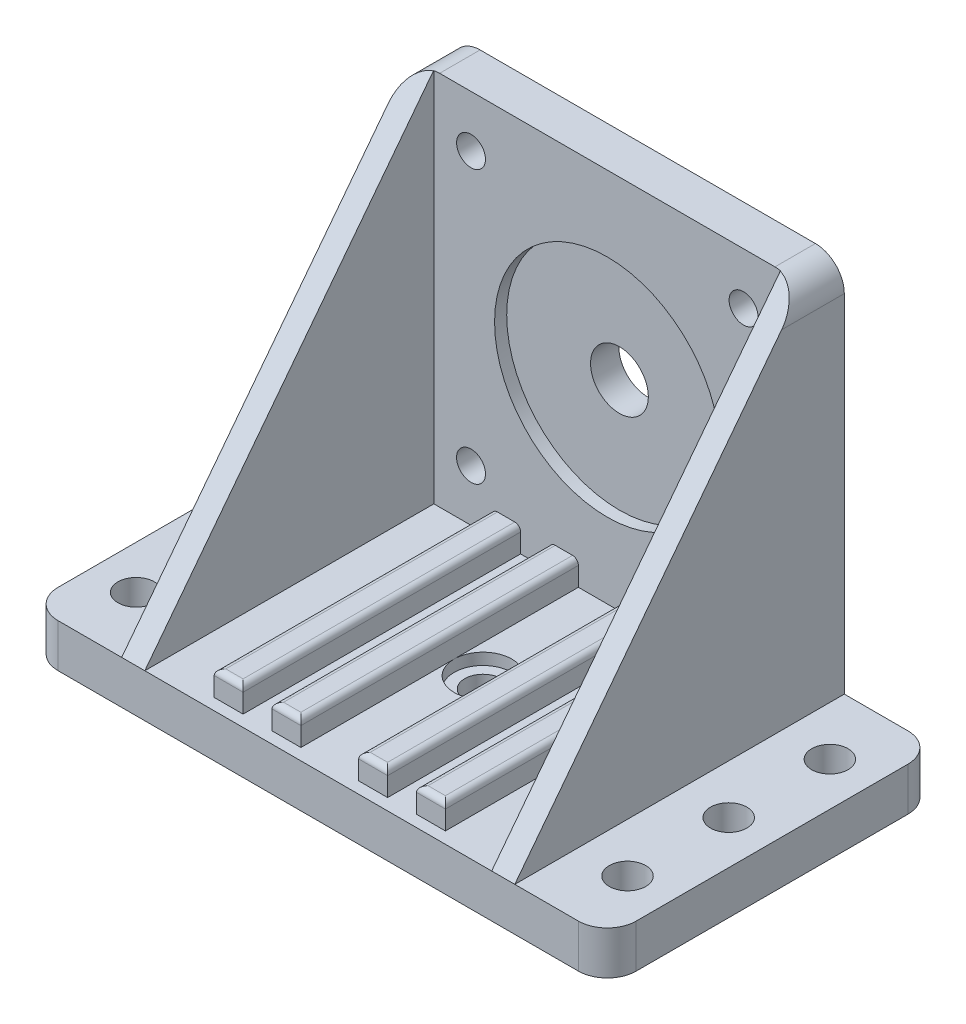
ISO-10303-21;
HEADER;
FILE_DESCRIPTION(('STEP AP214'),'2;1');
FILE_NAME('part.step','',(''),(''),'','','');
FILE_SCHEMA(('AUTOMOTIVE_DESIGN { 1 0 10303 214 1 1 1 1 }'));
ENDSEC;
DATA;
#1=APPLICATION_CONTEXT('core data for automotive mechanical design processes');
#2=APPLICATION_PROTOCOL_DEFINITION('international standard','automotive_design',2000,#1);
#3=PRODUCT_CONTEXT('',#1,'mechanical');
#4=PRODUCT('Part','Part','',(#3));
#5=PRODUCT_RELATED_PRODUCT_CATEGORY('part','',(#4));
#6=PRODUCT_DEFINITION_FORMATION('','',#4);
#7=PRODUCT_DEFINITION_CONTEXT('part definition',#1,'design');
#8=PRODUCT_DEFINITION('design','',#6,#7);
#9=PRODUCT_DEFINITION_SHAPE('','',#8);
#10=(LENGTH_UNIT() NAMED_UNIT(*) SI_UNIT(.MILLI.,.METRE.));
#11=(NAMED_UNIT(*) PLANE_ANGLE_UNIT() SI_UNIT($,.RADIAN.));
#12=(NAMED_UNIT(*) SI_UNIT($,.STERADIAN.) SOLID_ANGLE_UNIT());
#13=UNCERTAINTY_MEASURE_WITH_UNIT(LENGTH_MEASURE(1.E-05),#10,'distance_accuracy_value','');
#14=(GEOMETRIC_REPRESENTATION_CONTEXT(3) GLOBAL_UNCERTAINTY_ASSIGNED_CONTEXT((#13)) GLOBAL_UNIT_ASSIGNED_CONTEXT((#10,
#11,#12)) REPRESENTATION_CONTEXT('',''));
#15=CARTESIAN_POINT('',(0.,0.,0.));
#16=DIRECTION('',(0.,0.,1.));
#17=DIRECTION('',(1.,0.,0.));
#18=AXIS2_PLACEMENT_3D('',#15,#16,#17);
#19=CARTESIAN_POINT('',(0.,-65.,0.));
#20=DIRECTION('',(0.,1.,0.));
#21=DIRECTION('',(0.,0.,1.));
#22=AXIS2_PLACEMENT_3D('',#19,#20,#21);
#23=PLANE('',#22);
#24=DIRECTION('',(1.,0.,0.));
#25=VECTOR('',#24,1.);
#26=CARTESIAN_POINT('',(0.,-65.,7.));
#27=LINE('',#26,#25);
#28=CARTESIAN_POINT('',(0.,-65.,7.));
#29=VERTEX_POINT('',#28);
#30=CARTESIAN_POINT('',(10.,-65.,7.));
#31=VERTEX_POINT('',#30);
#32=EDGE_CURVE('E554',#29,#31,#27,.T.);
#33=ORIENTED_EDGE('',*,*,#32,.F.);
#34=DIRECTION('',(0.,0.,1.));
#35=VECTOR('',#34,1.);
#36=CARTESIAN_POINT('',(0.,-65.,0.));
#37=LINE('',#36,#35);
#38=CARTESIAN_POINT('',(0.,-65.,57.));
#39=VERTEX_POINT('',#38);
#40=EDGE_CURVE('E344',#29,#39,#37,.T.);
#41=ORIENTED_EDGE('',*,*,#40,.T.);
#42=DIRECTION('',(-1.,0.,0.));
#43=VECTOR('',#42,1.);
#44=CARTESIAN_POINT('',(0.,-65.,57.));
#45=LINE('',#44,#43);
#46=CARTESIAN_POINT('',(60.,-65.,57.));
#47=VERTEX_POINT('',#46);
#48=EDGE_CURVE('E517',#47,#39,#45,.T.);
#49=ORIENTED_EDGE('',*,*,#48,.F.);
#50=DIRECTION('',(0.,0.,-1.));
#51=VECTOR('',#50,1.);
#52=CARTESIAN_POINT('',(60.,-65.,57.));
#53=LINE('',#52,#51);
#54=CARTESIAN_POINT('',(60.,-65.,7.));
#55=VERTEX_POINT('',#54);
#56=EDGE_CURVE('E351',#47,#55,#53,.T.);
#57=ORIENTED_EDGE('',*,*,#56,.T.);
#58=CARTESIAN_POINT('',(50.,-65.,7.));
#59=VERTEX_POINT('',#58);
#60=EDGE_CURVE('E553',#59,#55,#27,.T.);
#61=ORIENTED_EDGE('',*,*,#60,.F.);
#62=DIRECTION('',(0.,0.,-1.));
#63=VECTOR('',#62,1.);
#64=CARTESIAN_POINT('',(50.,-65.,7.));
#65=LINE('',#64,#63);
#66=CARTESIAN_POINT('',(50.,-65.,55.));
#67=VERTEX_POINT('',#66);
#68=EDGE_CURVE('E478',#67,#59,#65,.T.);
#69=ORIENTED_EDGE('',*,*,#68,.F.);
#70=DIRECTION('',(1.,0.,0.));
#71=VECTOR('',#70,1.);
#72=CARTESIAN_POINT('',(45.,-65.,55.));
#73=LINE('',#72,#71);
#74=CARTESIAN_POINT('',(45.,-65.,55.));
#75=VERTEX_POINT('',#74);
#76=EDGE_CURVE('E481',#75,#67,#73,.T.);
#77=ORIENTED_EDGE('',*,*,#76,.F.);
#78=DIRECTION('',(0.,0.,1.));
#79=VECTOR('',#78,1.);
#80=CARTESIAN_POINT('',(45.,-65.,7.));
#81=LINE('',#80,#79);
#82=CARTESIAN_POINT('',(45.,-65.,7.));
#83=VERTEX_POINT('',#82);
#84=EDGE_CURVE('E473',#83,#75,#81,.T.);
#85=ORIENTED_EDGE('',*,*,#84,.F.);
#86=CARTESIAN_POINT('',(40.,-65.,7.));
#87=VERTEX_POINT('',#86);
#88=EDGE_CURVE('E742',#87,#83,#27,.T.);
#89=ORIENTED_EDGE('',*,*,#88,.F.);
#90=DIRECTION('',(0.,0.,-1.));
#91=VECTOR('',#90,1.);
#92=CARTESIAN_POINT('',(40.,-65.,7.));
#93=LINE('',#92,#91);
#94=CARTESIAN_POINT('',(40.,-65.,55.));
#95=VERTEX_POINT('',#94);
#96=EDGE_CURVE('E457',#95,#87,#93,.T.);
#97=ORIENTED_EDGE('',*,*,#96,.F.);
#98=DIRECTION('',(1.,0.,0.));
#99=VECTOR('',#98,1.);
#100=CARTESIAN_POINT('',(35.,-65.,55.));
#101=LINE('',#100,#99);
#102=CARTESIAN_POINT('',(35.,-65.,55.));
#103=VERTEX_POINT('',#102);
#104=EDGE_CURVE('E461',#103,#95,#101,.T.);
#105=ORIENTED_EDGE('',*,*,#104,.F.);
#106=DIRECTION('',(0.,0.,1.));
#107=VECTOR('',#106,1.);
#108=CARTESIAN_POINT('',(35.,-65.,7.));
#109=LINE('',#108,#107);
#110=CARTESIAN_POINT('',(35.,-65.,28.5));
#111=VERTEX_POINT('',#110);
#112=EDGE_CURVE('E452',#111,#103,#109,.T.);
#113=ORIENTED_EDGE('',*,*,#112,.F.);
#114=CARTESIAN_POINT('',(30.,-65.,28.5));
#115=DIRECTION('',(0.,1.,0.));
#116=DIRECTION('',(0.,0.,1.));
#117=AXIS2_PLACEMENT_3D('',#114,#115,#116);
#118=CIRCLE('',#117,5.);
#119=CARTESIAN_POINT('',(25.,-65.,28.5));
#120=VERTEX_POINT('',#119);
#121=EDGE_CURVE('E367',#120,#111,#118,.T.);
#122=ORIENTED_EDGE('',*,*,#121,.F.);
#123=DIRECTION('',(0.,0.,-1.));
#124=VECTOR('',#123,1.);
#125=CARTESIAN_POINT('',(25.,-65.,7.));
#126=LINE('',#125,#124);
#127=CARTESIAN_POINT('',(25.,-65.,55.));
#128=VERTEX_POINT('',#127);
#129=EDGE_CURVE('E435',#128,#120,#126,.T.);
#130=ORIENTED_EDGE('',*,*,#129,.F.);
#131=DIRECTION('',(1.,0.,0.));
#132=VECTOR('',#131,1.);
#133=CARTESIAN_POINT('',(20.,-65.,55.));
#134=LINE('',#133,#132);
#135=CARTESIAN_POINT('',(20.,-65.,55.));
#136=VERTEX_POINT('',#135);
#137=EDGE_CURVE('E439',#136,#128,#134,.T.);
#138=ORIENTED_EDGE('',*,*,#137,.F.);
#139=DIRECTION('',(0.,0.,1.));
#140=VECTOR('',#139,1.);
#141=CARTESIAN_POINT('',(20.,-65.,7.));
#142=LINE('',#141,#140);
#143=CARTESIAN_POINT('',(20.,-65.,7.));
#144=VERTEX_POINT('',#143);
#145=EDGE_CURVE('E436',#144,#136,#142,.T.);
#146=ORIENTED_EDGE('',*,*,#145,.F.);
#147=CARTESIAN_POINT('',(15.,-65.,7.));
#148=VERTEX_POINT('',#147);
#149=EDGE_CURVE('E558',#148,#144,#27,.T.);
#150=ORIENTED_EDGE('',*,*,#149,.F.);
#151=DIRECTION('',(0.,0.,-1.));
#152=VECTOR('',#151,1.);
#153=CARTESIAN_POINT('',(15.,-65.,7.));
#154=LINE('',#153,#152);
#155=CARTESIAN_POINT('',(15.,-65.,55.));
#156=VERTEX_POINT('',#155);
#157=EDGE_CURVE('E498',#156,#148,#154,.T.);
#158=ORIENTED_EDGE('',*,*,#157,.F.);
#159=DIRECTION('',(1.,0.,0.));
#160=VECTOR('',#159,1.);
#161=CARTESIAN_POINT('',(10.,-65.,55.));
#162=LINE('',#161,#160);
#163=CARTESIAN_POINT('',(10.,-65.,55.));
#164=VERTEX_POINT('',#163);
#165=EDGE_CURVE('E501',#164,#156,#162,.T.);
#166=ORIENTED_EDGE('',*,*,#165,.F.);
#167=DIRECTION('',(0.,0.,1.));
#168=VECTOR('',#167,1.);
#169=CARTESIAN_POINT('',(10.,-65.,7.));
#170=LINE('',#169,#168);
#171=EDGE_CURVE('E493',#31,#164,#170,.T.);
#172=ORIENTED_EDGE('',*,*,#171,.F.);
#173=EDGE_LOOP('',(#33,#41,#49,#57,#61,#69,#77,#85,#89,#97,#105,#113,#122,#130,#138,#146,#150,
#158,#166,#172));
#174=FACE_BOUND('',#173,.T.);
#175=ADVANCED_FACE('F32',(#174),#23,.T.);
#176=DIRECTION('',(1.,0.,0.));
#177=VECTOR('',#176,1.);
#178=CARTESIAN_POINT('',(80.,-65.,0.));
#179=LINE('',#178,#177);
#180=CARTESIAN_POINT('',(-15.,-65.,0.));
#181=VERTEX_POINT('',#180);
#182=CARTESIAN_POINT('',(-4.,-65.,0.));
#183=VERTEX_POINT('',#182);
#184=EDGE_CURVE('E323',#181,#183,#179,.T.);
#185=ORIENTED_EDGE('',*,*,#184,.F.);
#186=CARTESIAN_POINT('',(-15.,-65.,5.));
#187=DIRECTION('',(0.,1.,0.));
#188=DIRECTION('',(0.,0.,1.));
#189=AXIS2_PLACEMENT_3D('',#186,#187,#188);
#190=CIRCLE('',#189,5.);
#191=CARTESIAN_POINT('',(-20.,-65.,5.));
#192=VERTEX_POINT('',#191);
#193=EDGE_CURVE('E594',#181,#192,#190,.T.);
#194=ORIENTED_EDGE('',*,*,#193,.T.);
#195=DIRECTION('',(0.,0.,-1.));
#196=VECTOR('',#195,1.);
#197=CARTESIAN_POINT('',(-20.,-65.,0.));
#198=LINE('',#197,#196);
#199=CARTESIAN_POINT('',(-20.,-65.,52.));
#200=VERTEX_POINT('',#199);
#201=EDGE_CURVE('E417',#200,#192,#198,.T.);
#202=ORIENTED_EDGE('',*,*,#201,.F.);
#203=CARTESIAN_POINT('',(-15.,-65.,52.));
#204=DIRECTION('',(0.,1.,0.));
#205=DIRECTION('',(0.,0.,1.));
#206=AXIS2_PLACEMENT_3D('',#203,#204,#205);
#207=CIRCLE('',#206,5.);
#208=CARTESIAN_POINT('',(-15.,-65.,57.));
#209=VERTEX_POINT('',#208);
#210=EDGE_CURVE('E592',#200,#209,#207,.T.);
#211=ORIENTED_EDGE('',*,*,#210,.T.);
#212=CARTESIAN_POINT('',(-4.,-65.,57.));
#213=VERTEX_POINT('',#212);
#214=EDGE_CURVE('E337',#213,#209,#45,.T.);
#215=ORIENTED_EDGE('',*,*,#214,.F.);
#216=DIRECTION('',(0.,0.,1.));
#217=VECTOR('',#216,1.);
#218=CARTESIAN_POINT('',(-4.,-65.,0.));
#219=LINE('',#218,#217);
#220=EDGE_CURVE('E315',#183,#213,#219,.T.);
#221=ORIENTED_EDGE('',*,*,#220,.F.);
#222=EDGE_LOOP('',(#185,#194,#202,#211,#215,#221));
#223=FACE_BOUND('',#222,.T.);
#224=CARTESIAN_POINT('',(-12.5,-65.,28.5));
#225=DIRECTION('',(0.,1.,0.));
#226=DIRECTION('',(0.,0.,1.));
#227=AXIS2_PLACEMENT_3D('',#224,#225,#226);
#228=CIRCLE('',#227,3.15);
#229=CARTESIAN_POINT('',(-12.5,-65.,31.65));
#230=VERTEX_POINT('',#229);
#231=EDGE_CURVE('E399',#230,#230,#228,.T.);
#232=ORIENTED_EDGE('',*,*,#231,.F.);
#233=EDGE_LOOP('',(#232));
#234=FACE_BOUND('',#233,.T.);
#235=CARTESIAN_POINT('',(-12.5,-65.,46.));
#236=DIRECTION('',(0.,1.,0.));
#237=DIRECTION('',(0.,0.,1.));
#238=AXIS2_PLACEMENT_3D('',#235,#236,#237);
#239=CIRCLE('',#238,3.15);
#240=CARTESIAN_POINT('',(-12.5,-65.,49.15));
#241=VERTEX_POINT('',#240);
#242=EDGE_CURVE('E378',#241,#241,#239,.T.);
#243=ORIENTED_EDGE('',*,*,#242,.F.);
#244=EDGE_LOOP('',(#243));
#245=FACE_BOUND('',#244,.T.);
#246=CARTESIAN_POINT('',(-12.5,-65.,11.));
#247=DIRECTION('',(0.,1.,0.));
#248=DIRECTION('',(0.,0.,1.));
#249=AXIS2_PLACEMENT_3D('',#246,#247,#248);
#250=CIRCLE('',#249,3.15);
#251=CARTESIAN_POINT('',(-12.5,-65.,14.15));
#252=VERTEX_POINT('',#251);
#253=EDGE_CURVE('E387',#252,#252,#250,.T.);
#254=ORIENTED_EDGE('',*,*,#253,.F.);
#255=EDGE_LOOP('',(#254));
#256=FACE_BOUND('',#255,.T.);
#257=ADVANCED_FACE('F334',(#223,#234,#245,#256),#23,.T.);
#258=EDGE_CURVE('E372',#111,#120,#118,.T.);
#259=ORIENTED_EDGE('',*,*,#258,.F.);
#260=CARTESIAN_POINT('',(35.,-65.,7.));
#261=VERTEX_POINT('',#260);
#262=EDGE_CURVE('E458',#261,#111,#109,.T.);
#263=ORIENTED_EDGE('',*,*,#262,.F.);
#264=CARTESIAN_POINT('',(25.,-65.,7.));
#265=VERTEX_POINT('',#264);
#266=EDGE_CURVE('E559',#265,#261,#27,.T.);
#267=ORIENTED_EDGE('',*,*,#266,.F.);
#268=EDGE_CURVE('E442',#120,#265,#126,.T.);
#269=ORIENTED_EDGE('',*,*,#268,.F.);
#270=EDGE_LOOP('',(#259,#263,#267,#269));
#271=FACE_BOUND('',#270,.T.);
#272=ADVANCED_FACE('F873',(#271),#23,.T.);
#273=CARTESIAN_POINT('',(30.,-72.5,28.5));
#274=DIRECTION('',(0.,1.,0.));
#275=DIRECTION('',(0.,0.,1.));
#276=AXIS2_PLACEMENT_3D('',#273,#274,#275);
#277=CYLINDRICAL_SURFACE('',#276,3.15);
#278=CARTESIAN_POINT('',(30.,-72.5,28.5));
#279=DIRECTION('',(0.,1.,0.));
#280=DIRECTION('',(0.,0.,1.));
#281=AXIS2_PLACEMENT_3D('',#278,#279,#280);
#282=CIRCLE('',#281,3.15);
#283=CARTESIAN_POINT('',(30.,-72.5,31.65));
#284=VERTEX_POINT('',#283);
#285=EDGE_CURVE('E381',#284,#284,#282,.T.);
#286=ORIENTED_EDGE('',*,*,#285,.F.);
#287=EDGE_LOOP('',(#286));
#288=FACE_BOUND('',#287,.T.);
#289=CARTESIAN_POINT('',(30.,-67.,28.5));
#290=DIRECTION('',(0.,1.,0.));
#291=DIRECTION('',(0.,0.,1.));
#292=AXIS2_PLACEMENT_3D('',#289,#290,#291);
#293=CIRCLE('',#292,3.15);
#294=CARTESIAN_POINT('',(30.,-67.,31.65));
#295=VERTEX_POINT('',#294);
#296=EDGE_CURVE('E371',#295,#295,#293,.F.);
#297=ORIENTED_EDGE('',*,*,#296,.F.);
#298=EDGE_LOOP('',(#297));
#299=FACE_BOUND('',#298,.T.);
#300=ADVANCED_FACE('F886',(#288,#299),#277,.F.);
#301=CARTESIAN_POINT('',(30.,-32.5,0.));
#302=DIRECTION('',(0.,0.,1.));
#303=DIRECTION('',(1.,0.,0.));
#304=AXIS2_PLACEMENT_3D('',#301,#302,#303);
#305=CYLINDRICAL_SURFACE('',#304,5.);
#306=CARTESIAN_POINT('',(30.,-32.5,0.));
#307=DIRECTION('',(0.,0.,1.));
#308=DIRECTION('',(1.,0.,0.));
#309=AXIS2_PLACEMENT_3D('',#306,#307,#308);
#310=CIRCLE('',#309,5.);
#311=CARTESIAN_POINT('',(35.,-32.5,0.));
#312=VERTEX_POINT('',#311);
#313=EDGE_CURVE('E527',#312,#312,#310,.T.);
#314=ORIENTED_EDGE('',*,*,#313,.F.);
#315=EDGE_LOOP('',(#314));
#316=FACE_BOUND('',#315,.T.);
#317=CARTESIAN_POINT('',(30.,-32.5,4.9));
#318=DIRECTION('',(0.,0.,1.));
#319=DIRECTION('',(1.,0.,0.));
#320=AXIS2_PLACEMENT_3D('',#317,#318,#319);
#321=CIRCLE('',#320,5.);
#322=CARTESIAN_POINT('',(35.,-32.5,4.9));
#323=VERTEX_POINT('',#322);
#324=EDGE_CURVE('E428',#323,#323,#321,.F.);
#325=ORIENTED_EDGE('',*,*,#324,.F.);
#326=EDGE_LOOP('',(#325));
#327=FACE_BOUND('',#326,.T.);
#328=ADVANCED_FACE('F882',(#316,#327),#305,.F.);
#329=CARTESIAN_POINT('',(0.,0.,7.));
#330=DIRECTION('',(0.,0.,1.));
#331=DIRECTION('',(1.,0.,0.));
#332=AXIS2_PLACEMENT_3D('',#329,#330,#331);
#333=PLANE('',#332);
#334=CARTESIAN_POINT('',(30.,-32.5,7.));
#335=DIRECTION('',(0.,0.,1.));
#336=DIRECTION('',(1.,0.,0.));
#337=AXIS2_PLACEMENT_3D('',#334,#335,#336);
#338=CIRCLE('',#337,19.5);
#339=CARTESIAN_POINT('',(49.5,-32.5,7.));
#340=VERTEX_POINT('',#339);
#341=EDGE_CURVE('E331',#340,#340,#338,.T.);
#342=ORIENTED_EDGE('',*,*,#341,.F.);
#343=EDGE_LOOP('',(#342));
#344=FACE_BOUND('',#343,.T.);
#345=CARTESIAN_POINT('',(6.43,-56.07,7.));
#346=DIRECTION('',(0.,0.,1.));
#347=DIRECTION('',(1.,0.,0.));
#348=AXIS2_PLACEMENT_3D('',#345,#346,#347);
#349=CIRCLE('',#348,2.5);
#350=CARTESIAN_POINT('',(8.93,-56.07,7.));
#351=VERTEX_POINT('',#350);
#352=EDGE_CURVE('E523',#351,#351,#349,.T.);
#353=ORIENTED_EDGE('',*,*,#352,.F.);
#354=EDGE_LOOP('',(#353));
#355=FACE_BOUND('',#354,.T.);
#356=CARTESIAN_POINT('',(53.57,-56.07,7.));
#357=DIRECTION('',(0.,0.,1.));
#358=DIRECTION('',(1.,0.,0.));
#359=AXIS2_PLACEMENT_3D('',#356,#357,#358);
#360=CIRCLE('',#359,2.5);
#361=CARTESIAN_POINT('',(56.07,-56.07,7.));
#362=VERTEX_POINT('',#361);
#363=EDGE_CURVE('E540',#362,#362,#360,.T.);
#364=ORIENTED_EDGE('',*,*,#363,.F.);
#365=EDGE_LOOP('',(#364));
#366=FACE_BOUND('',#365,.T.);
#367=CARTESIAN_POINT('',(53.57,-8.93,7.));
#368=DIRECTION('',(0.,0.,1.));
#369=DIRECTION('',(1.,0.,0.));
#370=AXIS2_PLACEMENT_3D('',#367,#368,#369);
#371=CIRCLE('',#370,2.5);
#372=CARTESIAN_POINT('',(56.07,-8.93,7.));
#373=VERTEX_POINT('',#372);
#374=EDGE_CURVE('E534',#373,#373,#371,.T.);
#375=ORIENTED_EDGE('',*,*,#374,.F.);
#376=EDGE_LOOP('',(#375));
#377=FACE_BOUND('',#376,.T.);
#378=CARTESIAN_POINT('',(6.42999999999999,-8.93,7.));
#379=DIRECTION('',(0.,0.,1.));
#380=DIRECTION('',(1.,0.,0.));
#381=AXIS2_PLACEMENT_3D('',#378,#379,#380);
#382=CIRCLE('',#381,2.5);
#383=CARTESIAN_POINT('',(8.92999999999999,-8.93,7.));
#384=VERTEX_POINT('',#383);
#385=EDGE_CURVE('E528',#384,#384,#382,.T.);
#386=ORIENTED_EDGE('',*,*,#385,.F.);
#387=EDGE_LOOP('',(#386));
#388=FACE_BOUND('',#387,.T.);
#389=DIRECTION('',(0.,1.,0.));
#390=VECTOR('',#389,1.);
#391=CARTESIAN_POINT('',(60.,0.,7.));
#392=LINE('',#391,#390);
#393=CARTESIAN_POINT('',(60.,-0.101020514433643,7.));
#394=VERTEX_POINT('',#393);
#395=EDGE_CURVE('E557',#55,#394,#392,.T.);
#396=ORIENTED_EDGE('',*,*,#395,.T.);
#397=CARTESIAN_POINT('',(59.,-5.,7.));
#398=DIRECTION('',(0.,0.,1.));
#399=DIRECTION('',(1.,0.,0.));
#400=AXIS2_PLACEMENT_3D('',#397,#398,#399);
#401=CIRCLE('',#400,5.);
#402=CARTESIAN_POINT('',(59.,0.,7.));
#403=VERTEX_POINT('',#402);
#404=EDGE_CURVE('E619',#394,#403,#401,.T.);
#405=ORIENTED_EDGE('',*,*,#404,.T.);
#406=DIRECTION('',(-1.,0.,0.));
#407=VECTOR('',#406,1.);
#408=CARTESIAN_POINT('',(0.,0.,7.));
#409=LINE('',#408,#407);
#410=CARTESIAN_POINT('',(1.,0.,7.));
#411=VERTEX_POINT('',#410);
#412=EDGE_CURVE('E562',#403,#411,#409,.T.);
#413=ORIENTED_EDGE('',*,*,#412,.T.);
#414=CARTESIAN_POINT('',(1.,-5.,7.));
#415=DIRECTION('',(0.,0.,1.));
#416=DIRECTION('',(1.,0.,0.));
#417=AXIS2_PLACEMENT_3D('',#414,#415,#416);
#418=CIRCLE('',#417,5.);
#419=CARTESIAN_POINT('',(0.,-0.101020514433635,7.));
#420=VERTEX_POINT('',#419);
#421=EDGE_CURVE('E617',#411,#420,#418,.T.);
#422=ORIENTED_EDGE('',*,*,#421,.T.);
#423=DIRECTION('',(0.,-1.,0.));
#424=VECTOR('',#423,1.);
#425=CARTESIAN_POINT('',(0.,0.,7.));
#426=LINE('',#425,#424);
#427=EDGE_CURVE('E551',#420,#29,#426,.T.);
#428=ORIENTED_EDGE('',*,*,#427,.T.);
#429=ORIENTED_EDGE('',*,*,#32,.T.);
#430=DIRECTION('',(0.,-1.,0.));
#431=VECTOR('',#430,1.);
#432=CARTESIAN_POINT('',(10.,-60.72,7.));
#433=LINE('',#432,#431);
#434=CARTESIAN_POINT('',(10.,-61.72,7.));
#435=VERTEX_POINT('',#434);
#436=EDGE_CURVE('E497',#435,#31,#433,.T.);
#437=ORIENTED_EDGE('',*,*,#436,.F.);
#438=CARTESIAN_POINT('',(11.,-61.72,7.));
#439=DIRECTION('',(0.,0.,1.));
#440=DIRECTION('',(1.,0.,0.));
#441=AXIS2_PLACEMENT_3D('',#438,#439,#440);
#442=CIRCLE('',#441,1.);
#443=CARTESIAN_POINT('',(11.,-60.72,7.));
#444=VERTEX_POINT('',#443);
#445=EDGE_CURVE('E41',#435,#444,#442,.F.);
#446=ORIENTED_EDGE('',*,*,#445,.T.);
#447=DIRECTION('',(-1.,0.,0.));
#448=VECTOR('',#447,1.);
#449=CARTESIAN_POINT('',(10.,-60.72,7.));
#450=LINE('',#449,#448);
#451=CARTESIAN_POINT('',(14.,-60.72,7.));
#452=VERTEX_POINT('',#451);
#453=EDGE_CURVE('E494',#452,#444,#450,.T.);
#454=ORIENTED_EDGE('',*,*,#453,.F.);
#455=CARTESIAN_POINT('',(14.,-61.72,7.));
#456=DIRECTION('',(0.,0.,1.));
#457=DIRECTION('',(1.,0.,0.));
#458=AXIS2_PLACEMENT_3D('',#455,#456,#457);
#459=CIRCLE('',#458,1.);
#460=CARTESIAN_POINT('',(15.,-61.72,7.));
#461=VERTEX_POINT('',#460);
#462=EDGE_CURVE('E11',#452,#461,#459,.F.);
#463=ORIENTED_EDGE('',*,*,#462,.T.);
#464=DIRECTION('',(0.,-1.,0.));
#465=VECTOR('',#464,1.);
#466=CARTESIAN_POINT('',(15.,-60.72,7.));
#467=LINE('',#466,#465);
#468=EDGE_CURVE('E507',#461,#148,#467,.T.);
#469=ORIENTED_EDGE('',*,*,#468,.T.);
#470=ORIENTED_EDGE('',*,*,#149,.T.);
#471=DIRECTION('',(0.,-1.,0.));
#472=VECTOR('',#471,1.);
#473=CARTESIAN_POINT('',(20.,-60.72,7.));
#474=LINE('',#473,#472);
#475=CARTESIAN_POINT('',(20.,-61.72,7.));
#476=VERTEX_POINT('',#475);
#477=EDGE_CURVE('E434',#476,#144,#474,.T.);
#478=ORIENTED_EDGE('',*,*,#477,.F.);
#479=CARTESIAN_POINT('',(21.,-61.72,7.));
#480=DIRECTION('',(0.,0.,1.));
#481=DIRECTION('',(1.,0.,0.));
#482=AXIS2_PLACEMENT_3D('',#479,#480,#481);
#483=CIRCLE('',#482,1.);
#484=CARTESIAN_POINT('',(21.,-60.72,7.));
#485=VERTEX_POINT('',#484);
#486=EDGE_CURVE('E689',#476,#485,#483,.F.);
#487=ORIENTED_EDGE('',*,*,#486,.T.);
#488=DIRECTION('',(-1.,0.,0.));
#489=VECTOR('',#488,1.);
#490=CARTESIAN_POINT('',(20.,-60.72,7.));
#491=LINE('',#490,#489);
#492=CARTESIAN_POINT('',(24.,-60.72,7.));
#493=VERTEX_POINT('',#492);
#494=EDGE_CURVE('E431',#493,#485,#491,.T.);
#495=ORIENTED_EDGE('',*,*,#494,.F.);
#496=CARTESIAN_POINT('',(24.,-61.72,7.));
#497=DIRECTION('',(0.,0.,1.));
#498=DIRECTION('',(1.,0.,0.));
#499=AXIS2_PLACEMENT_3D('',#496,#497,#498);
#500=CIRCLE('',#499,1.);
#501=CARTESIAN_POINT('',(25.,-61.72,7.));
#502=VERTEX_POINT('',#501);
#503=EDGE_CURVE('E691',#493,#502,#500,.F.);
#504=ORIENTED_EDGE('',*,*,#503,.T.);
#505=DIRECTION('',(0.,-1.,0.));
#506=VECTOR('',#505,1.);
#507=CARTESIAN_POINT('',(25.,-60.72,7.));
#508=LINE('',#507,#506);
#509=EDGE_CURVE('E446',#502,#265,#508,.T.);
#510=ORIENTED_EDGE('',*,*,#509,.T.);
#511=ORIENTED_EDGE('',*,*,#266,.T.);
#512=DIRECTION('',(0.,-1.,0.));
#513=VECTOR('',#512,1.);
#514=CARTESIAN_POINT('',(35.,-60.72,7.));
#515=LINE('',#514,#513);
#516=CARTESIAN_POINT('',(35.,-61.72,7.));
#517=VERTEX_POINT('',#516);
#518=EDGE_CURVE('E456',#517,#261,#515,.T.);
#519=ORIENTED_EDGE('',*,*,#518,.F.);
#520=CARTESIAN_POINT('',(36.,-61.72,7.));
#521=DIRECTION('',(0.,0.,1.));
#522=DIRECTION('',(1.,0.,0.));
#523=AXIS2_PLACEMENT_3D('',#520,#521,#522);
#524=CIRCLE('',#523,1.);
#525=CARTESIAN_POINT('',(36.,-60.72,7.));
#526=VERTEX_POINT('',#525);
#527=EDGE_CURVE('E687',#517,#526,#524,.F.);
#528=ORIENTED_EDGE('',*,*,#527,.T.);
#529=DIRECTION('',(-1.,0.,0.));
#530=VECTOR('',#529,1.);
#531=CARTESIAN_POINT('',(35.,-60.72,7.));
#532=LINE('',#531,#530);
#533=CARTESIAN_POINT('',(39.,-60.72,7.));
#534=VERTEX_POINT('',#533);
#535=EDGE_CURVE('E453',#534,#526,#532,.T.);
#536=ORIENTED_EDGE('',*,*,#535,.F.);
#537=CARTESIAN_POINT('',(39.,-61.72,7.));
#538=DIRECTION('',(0.,0.,1.));
#539=DIRECTION('',(1.,0.,0.));
#540=AXIS2_PLACEMENT_3D('',#537,#538,#539);
#541=CIRCLE('',#540,1.);
#542=CARTESIAN_POINT('',(40.,-61.72,7.));
#543=VERTEX_POINT('',#542);
#544=EDGE_CURVE('E685',#534,#543,#541,.F.);
#545=ORIENTED_EDGE('',*,*,#544,.T.);
#546=DIRECTION('',(0.,-1.,0.));
#547=VECTOR('',#546,1.);
#548=CARTESIAN_POINT('',(40.,-60.72,7.));
#549=LINE('',#548,#547);
#550=EDGE_CURVE('E467',#543,#87,#549,.T.);
#551=ORIENTED_EDGE('',*,*,#550,.T.);
#552=ORIENTED_EDGE('',*,*,#88,.T.);
#553=DIRECTION('',(0.,-1.,0.));
#554=VECTOR('',#553,1.);
#555=CARTESIAN_POINT('',(45.,-60.72,7.));
#556=LINE('',#555,#554);
#557=CARTESIAN_POINT('',(45.,-61.72,7.));
#558=VERTEX_POINT('',#557);
#559=EDGE_CURVE('E477',#558,#83,#556,.T.);
#560=ORIENTED_EDGE('',*,*,#559,.F.);
#561=CARTESIAN_POINT('',(46.,-61.72,7.));
#562=DIRECTION('',(0.,0.,1.));
#563=DIRECTION('',(1.,0.,0.));
#564=AXIS2_PLACEMENT_3D('',#561,#562,#563);
#565=CIRCLE('',#564,1.);
#566=CARTESIAN_POINT('',(46.,-60.72,7.));
#567=VERTEX_POINT('',#566);
#568=EDGE_CURVE('E681',#558,#567,#565,.F.);
#569=ORIENTED_EDGE('',*,*,#568,.T.);
#570=DIRECTION('',(-1.,0.,0.));
#571=VECTOR('',#570,1.);
#572=CARTESIAN_POINT('',(45.,-60.72,7.));
#573=LINE('',#572,#571);
#574=CARTESIAN_POINT('',(49.,-60.72,7.));
#575=VERTEX_POINT('',#574);
#576=EDGE_CURVE('E474',#575,#567,#573,.T.);
#577=ORIENTED_EDGE('',*,*,#576,.F.);
#578=CARTESIAN_POINT('',(49.,-61.72,7.));
#579=DIRECTION('',(0.,0.,1.));
#580=DIRECTION('',(1.,0.,0.));
#581=AXIS2_PLACEMENT_3D('',#578,#579,#580);
#582=CIRCLE('',#581,1.);
#583=CARTESIAN_POINT('',(50.,-61.72,7.));
#584=VERTEX_POINT('',#583);
#585=EDGE_CURVE('E683',#575,#584,#582,.F.);
#586=ORIENTED_EDGE('',*,*,#585,.T.);
#587=DIRECTION('',(0.,-1.,0.));
#588=VECTOR('',#587,1.);
#589=CARTESIAN_POINT('',(50.,-60.72,7.));
#590=LINE('',#589,#588);
#591=EDGE_CURVE('E487',#584,#59,#590,.T.);
#592=ORIENTED_EDGE('',*,*,#591,.T.);
#593=ORIENTED_EDGE('',*,*,#60,.T.);
#594=EDGE_LOOP('',(#396,#405,#413,#422,#428,#429,#437,#446,#454,#463,#469,#470,#478,#487,#495,
#504,#510,#511,#519,#528,#536,#545,#551,#552,#560,#569,#577,#586,#592,#593));
#595=FACE_BOUND('',#594,.T.);
#596=ADVANCED_FACE('F720',(#344,#355,#366,#377,#388,#595),#333,.T.);
#597=CARTESIAN_POINT('',(75.,-65.,57.));
#598=VERTEX_POINT('',#597);
#599=CARTESIAN_POINT('',(64.,-65.,57.));
#600=VERTEX_POINT('',#599);
#601=EDGE_CURVE('E513',#598,#600,#45,.T.);
#602=ORIENTED_EDGE('',*,*,#601,.F.);
#603=CARTESIAN_POINT('',(75.,-65.,52.));
#604=DIRECTION('',(0.,1.,0.));
#605=DIRECTION('',(0.,0.,1.));
#606=AXIS2_PLACEMENT_3D('',#603,#604,#605);
#607=CIRCLE('',#606,5.);
#608=CARTESIAN_POINT('',(80.,-65.,52.));
#609=VERTEX_POINT('',#608);
#610=EDGE_CURVE('E608',#598,#609,#607,.T.);
#611=ORIENTED_EDGE('',*,*,#610,.T.);
#612=DIRECTION('',(0.,0.,1.));
#613=VECTOR('',#612,1.);
#614=CARTESIAN_POINT('',(80.,-65.,0.));
#615=LINE('',#614,#613);
#616=CARTESIAN_POINT('',(80.,-65.,5.));
#617=VERTEX_POINT('',#616);
#618=EDGE_CURVE('E414',#617,#609,#615,.T.);
#619=ORIENTED_EDGE('',*,*,#618,.F.);
#620=CARTESIAN_POINT('',(75.,-65.,5.));
#621=DIRECTION('',(0.,1.,0.));
#622=DIRECTION('',(0.,0.,1.));
#623=AXIS2_PLACEMENT_3D('',#620,#621,#622);
#624=CIRCLE('',#623,5.);
#625=CARTESIAN_POINT('',(75.,-65.,0.));
#626=VERTEX_POINT('',#625);
#627=EDGE_CURVE('E606',#617,#626,#624,.T.);
#628=ORIENTED_EDGE('',*,*,#627,.T.);
#629=CARTESIAN_POINT('',(64.,-65.,0.));
#630=VERTEX_POINT('',#629);
#631=EDGE_CURVE('E332',#630,#626,#179,.T.);
#632=ORIENTED_EDGE('',*,*,#631,.F.);
#633=DIRECTION('',(0.,0.,-1.));
#634=VECTOR('',#633,1.);
#635=CARTESIAN_POINT('',(64.,-65.,57.));
#636=LINE('',#635,#634);
#637=EDGE_CURVE('E352',#600,#630,#636,.T.);
#638=ORIENTED_EDGE('',*,*,#637,.F.);
#639=EDGE_LOOP('',(#602,#611,#619,#628,#632,#638));
#640=FACE_BOUND('',#639,.T.);
#641=CARTESIAN_POINT('',(72.5,-65.,46.));
#642=DIRECTION('',(0.,1.,0.));
#643=DIRECTION('',(0.,0.,1.));
#644=AXIS2_PLACEMENT_3D('',#641,#642,#643);
#645=CIRCLE('',#644,3.15);
#646=CARTESIAN_POINT('',(72.5,-65.,49.15));
#647=VERTEX_POINT('',#646);
#648=EDGE_CURVE('E377',#647,#647,#645,.T.);
#649=ORIENTED_EDGE('',*,*,#648,.F.);
#650=EDGE_LOOP('',(#649));
#651=FACE_BOUND('',#650,.T.);
#652=CARTESIAN_POINT('',(72.5,-65.,11.));
#653=DIRECTION('',(0.,1.,0.));
#654=DIRECTION('',(0.,0.,1.));
#655=AXIS2_PLACEMENT_3D('',#652,#653,#654);
#656=CIRCLE('',#655,3.15);
#657=CARTESIAN_POINT('',(72.5,-65.,14.15));
#658=VERTEX_POINT('',#657);
#659=EDGE_CURVE('E388',#658,#658,#656,.T.);
#660=ORIENTED_EDGE('',*,*,#659,.F.);
#661=EDGE_LOOP('',(#660));
#662=FACE_BOUND('',#661,.T.);
#663=CARTESIAN_POINT('',(72.5,-65.,28.5));
#664=DIRECTION('',(0.,1.,0.));
#665=DIRECTION('',(0.,0.,1.));
#666=AXIS2_PLACEMENT_3D('',#663,#664,#665);
#667=CIRCLE('',#666,3.15);
#668=CARTESIAN_POINT('',(72.5,-65.,31.65));
#669=VERTEX_POINT('',#668);
#670=EDGE_CURVE('E400',#669,#669,#667,.T.);
#671=ORIENTED_EDGE('',*,*,#670,.F.);
#672=EDGE_LOOP('',(#671));
#673=FACE_BOUND('',#672,.T.);
#674=ADVANCED_FACE('F848',(#640,#651,#662,#673),#23,.T.);
#675=CARTESIAN_POINT('',(0.,0.,7.));
#676=DIRECTION('',(0.,-1.,0.));
#677=DIRECTION('',(0.,0.,-1.));
#678=AXIS2_PLACEMENT_3D('',#675,#676,#677);
#679=PLANE('',#678);
#680=ORIENTED_EDGE('',*,*,#412,.F.);
#681=DIRECTION('',(0.,0.,1.));
#682=VECTOR('',#681,1.);
#683=CARTESIAN_POINT('',(59.,0.,0.));
#684=LINE('',#683,#682);
#685=CARTESIAN_POINT('',(59.,0.,0.));
#686=VERTEX_POINT('',#685);
#687=EDGE_CURVE('E623',#403,#686,#684,.F.);
#688=ORIENTED_EDGE('',*,*,#687,.T.);
#689=DIRECTION('',(-1.,0.,0.));
#690=VECTOR('',#689,1.);
#691=CARTESIAN_POINT('',(0.,0.,0.));
#692=LINE('',#691,#690);
#693=CARTESIAN_POINT('',(1.,0.,0.));
#694=VERTEX_POINT('',#693);
#695=EDGE_CURVE('E550',#686,#694,#692,.T.);
#696=ORIENTED_EDGE('',*,*,#695,.T.);
#697=DIRECTION('',(0.,0.,-1.));
#698=VECTOR('',#697,1.);
#699=CARTESIAN_POINT('',(1.,0.,7.));
#700=LINE('',#699,#698);
#701=EDGE_CURVE('E621',#694,#411,#700,.F.);
#702=ORIENTED_EDGE('',*,*,#701,.T.);
#703=EDGE_LOOP('',(#680,#688,#696,#702));
#704=FACE_BOUND('',#703,.T.);
#705=ADVANCED_FACE('F797',(#704),#679,.F.);
#706=CARTESIAN_POINT('',(0.,0.,0.));
#707=DIRECTION('',(0.,0.,1.));
#708=DIRECTION('',(1.,0.,0.));
#709=AXIS2_PLACEMENT_3D('',#706,#707,#708);
#710=PLANE('',#709);
#711=DIRECTION('',(1.,0.,0.));
#712=VECTOR('',#711,1.);
#713=CARTESIAN_POINT('',(0.,-72.5,0.));
#714=LINE('',#713,#712);
#715=CARTESIAN_POINT('',(-15.,-72.5,0.));
#716=VERTEX_POINT('',#715);
#717=CARTESIAN_POINT('',(75.,-72.5,0.));
#718=VERTEX_POINT('',#717);
#719=EDGE_CURVE('E520',#716,#718,#714,.T.);
#720=ORIENTED_EDGE('',*,*,#719,.F.);
#721=DIRECTION('',(0.,-1.,0.));
#722=VECTOR('',#721,1.);
#723=CARTESIAN_POINT('',(-15.,-65.,0.));
#724=LINE('',#723,#722);
#725=EDGE_CURVE('E328',#716,#181,#724,.F.);
#726=ORIENTED_EDGE('',*,*,#725,.T.);
#727=ORIENTED_EDGE('',*,*,#184,.T.);
#728=DIRECTION('',(0.,-1.,0.));
#729=VECTOR('',#728,1.);
#730=CARTESIAN_POINT('',(-4.,0.,0.));
#731=LINE('',#730,#729);
#732=CARTESIAN_POINT('',(-4.,-5.,0.));
#733=VERTEX_POINT('',#732);
#734=EDGE_CURVE('E310',#733,#183,#731,.T.);
#735=ORIENTED_EDGE('',*,*,#734,.F.);
#736=CARTESIAN_POINT('',(1.,-5.,0.));
#737=DIRECTION('',(0.,0.,1.));
#738=DIRECTION('',(1.,0.,0.));
#739=AXIS2_PLACEMENT_3D('',#736,#737,#738);
#740=CIRCLE('',#739,5.);
#741=EDGE_CURVE('E584',#733,#694,#740,.F.);
#742=ORIENTED_EDGE('',*,*,#741,.T.);
#743=ORIENTED_EDGE('',*,*,#695,.F.);
#744=CARTESIAN_POINT('',(59.,-5.,0.));
#745=DIRECTION('',(0.,0.,1.));
#746=DIRECTION('',(1.,0.,0.));
#747=AXIS2_PLACEMENT_3D('',#744,#745,#746);
#748=CIRCLE('',#747,5.);
#749=CARTESIAN_POINT('',(64.,-5.,0.));
#750=VERTEX_POINT('',#749);
#751=EDGE_CURVE('E586',#686,#750,#748,.F.);
#752=ORIENTED_EDGE('',*,*,#751,.T.);
#753=DIRECTION('',(0.,1.,0.));
#754=VECTOR('',#753,1.);
#755=CARTESIAN_POINT('',(64.,-65.,0.));
#756=LINE('',#755,#754);
#757=EDGE_CURVE('E355',#630,#750,#756,.T.);
#758=ORIENTED_EDGE('',*,*,#757,.F.);
#759=ORIENTED_EDGE('',*,*,#631,.T.);
#760=DIRECTION('',(0.,-1.,0.));
#761=VECTOR('',#760,1.);
#762=CARTESIAN_POINT('',(75.,-72.5,0.));
#763=LINE('',#762,#761);
#764=EDGE_CURVE('E588',#626,#718,#763,.T.);
#765=ORIENTED_EDGE('',*,*,#764,.T.);
#766=EDGE_LOOP('',(#720,#726,#727,#735,#742,#743,#752,#758,#759,#765));
#767=FACE_BOUND('',#766,.T.);
#768=ORIENTED_EDGE('',*,*,#313,.T.);
#769=EDGE_LOOP('',(#768));
#770=FACE_BOUND('',#769,.T.);
#771=CARTESIAN_POINT('',(6.42999999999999,-8.93,0.));
#772=DIRECTION('',(0.,0.,1.));
#773=DIRECTION('',(1.,0.,0.));
#774=AXIS2_PLACEMENT_3D('',#771,#772,#773);
#775=CIRCLE('',#774,2.5);
#776=CARTESIAN_POINT('',(8.92999999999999,-8.93,0.));
#777=VERTEX_POINT('',#776);
#778=EDGE_CURVE('E524',#777,#777,#775,.T.);
#779=ORIENTED_EDGE('',*,*,#778,.T.);
#780=EDGE_LOOP('',(#779));
#781=FACE_BOUND('',#780,.T.);
#782=CARTESIAN_POINT('',(53.57,-8.93,0.));
#783=DIRECTION('',(0.,0.,1.));
#784=DIRECTION('',(1.,0.,0.));
#785=AXIS2_PLACEMENT_3D('',#782,#783,#784);
#786=CIRCLE('',#785,2.5);
#787=CARTESIAN_POINT('',(56.07,-8.93,0.));
#788=VERTEX_POINT('',#787);
#789=EDGE_CURVE('E531',#788,#788,#786,.T.);
#790=ORIENTED_EDGE('',*,*,#789,.T.);
#791=EDGE_LOOP('',(#790));
#792=FACE_BOUND('',#791,.T.);
#793=CARTESIAN_POINT('',(53.57,-56.07,0.));
#794=DIRECTION('',(0.,0.,1.));
#795=DIRECTION('',(1.,0.,0.));
#796=AXIS2_PLACEMENT_3D('',#793,#794,#795);
#797=CIRCLE('',#796,2.5);
#798=CARTESIAN_POINT('',(56.07,-56.07,0.));
#799=VERTEX_POINT('',#798);
#800=EDGE_CURVE('E537',#799,#799,#797,.T.);
#801=ORIENTED_EDGE('',*,*,#800,.T.);
#802=EDGE_LOOP('',(#801));
#803=FACE_BOUND('',#802,.T.);
#804=CARTESIAN_POINT('',(6.43,-56.07,0.));
#805=DIRECTION('',(0.,0.,1.));
#806=DIRECTION('',(1.,0.,0.));
#807=AXIS2_PLACEMENT_3D('',#804,#805,#806);
#808=CIRCLE('',#807,2.5);
#809=CARTESIAN_POINT('',(8.93,-56.07,0.));
#810=VERTEX_POINT('',#809);
#811=EDGE_CURVE('E543',#810,#810,#808,.T.);
#812=ORIENTED_EDGE('',*,*,#811,.T.);
#813=EDGE_LOOP('',(#812));
#814=FACE_BOUND('',#813,.T.);
#815=ADVANCED_FACE('F325',(#767,#770,#781,#792,#803,#814),#710,.F.);
#816=CARTESIAN_POINT('',(6.42999999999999,-8.93,0.));
#817=DIRECTION('',(0.,0.,1.));
#818=DIRECTION('',(1.,0.,0.));
#819=AXIS2_PLACEMENT_3D('',#816,#817,#818);
#820=CYLINDRICAL_SURFACE('',#819,2.5);
#821=ORIENTED_EDGE('',*,*,#778,.F.);
#822=EDGE_LOOP('',(#821));
#823=FACE_BOUND('',#822,.T.);
#824=ORIENTED_EDGE('',*,*,#385,.T.);
#825=EDGE_LOOP('',(#824));
#826=FACE_BOUND('',#825,.T.);
#827=ADVANCED_FACE('F1103',(#823,#826),#820,.F.);
#828=CARTESIAN_POINT('',(53.57,-8.93,0.));
#829=DIRECTION('',(0.,0.,1.));
#830=DIRECTION('',(1.,0.,0.));
#831=AXIS2_PLACEMENT_3D('',#828,#829,#830);
#832=CYLINDRICAL_SURFACE('',#831,2.5);
#833=ORIENTED_EDGE('',*,*,#789,.F.);
#834=EDGE_LOOP('',(#833));
#835=FACE_BOUND('',#834,.T.);
#836=ORIENTED_EDGE('',*,*,#374,.T.);
#837=EDGE_LOOP('',(#836));
#838=FACE_BOUND('',#837,.T.);
#839=ADVANCED_FACE('F1407',(#835,#838),#832,.F.);
#840=CARTESIAN_POINT('',(53.57,-56.07,0.));
#841=DIRECTION('',(0.,0.,1.));
#842=DIRECTION('',(1.,0.,0.));
#843=AXIS2_PLACEMENT_3D('',#840,#841,#842);
#844=CYLINDRICAL_SURFACE('',#843,2.5);
#845=ORIENTED_EDGE('',*,*,#800,.F.);
#846=EDGE_LOOP('',(#845));
#847=FACE_BOUND('',#846,.T.);
#848=ORIENTED_EDGE('',*,*,#363,.T.);
#849=EDGE_LOOP('',(#848));
#850=FACE_BOUND('',#849,.T.);
#851=ADVANCED_FACE('F1400',(#847,#850),#844,.F.);
#852=CARTESIAN_POINT('',(6.43,-56.07,0.));
#853=DIRECTION('',(0.,0.,1.));
#854=DIRECTION('',(1.,0.,0.));
#855=AXIS2_PLACEMENT_3D('',#852,#853,#854);
#856=CYLINDRICAL_SURFACE('',#855,2.5);
#857=ORIENTED_EDGE('',*,*,#811,.F.);
#858=EDGE_LOOP('',(#857));
#859=FACE_BOUND('',#858,.T.);
#860=ORIENTED_EDGE('',*,*,#352,.T.);
#861=EDGE_LOOP('',(#860));
#862=FACE_BOUND('',#861,.T.);
#863=ADVANCED_FACE('F1166',(#859,#862),#856,.F.);
#864=CARTESIAN_POINT('',(0.,-72.5,0.));
#865=DIRECTION('',(0.,-1.,0.));
#866=DIRECTION('',(0.,0.,-1.));
#867=AXIS2_PLACEMENT_3D('',#864,#865,#866);
#868=PLANE('',#867);
#869=CARTESIAN_POINT('',(72.5,-72.5,46.));
#870=DIRECTION('',(0.,1.,0.));
#871=DIRECTION('',(0.,0.,1.));
#872=AXIS2_PLACEMENT_3D('',#869,#870,#871);
#873=CIRCLE('',#872,3.15);
#874=CARTESIAN_POINT('',(72.5,-72.5,49.15));
#875=VERTEX_POINT('',#874);
#876=EDGE_CURVE('E391',#875,#875,#873,.T.);
#877=ORIENTED_EDGE('',*,*,#876,.T.);
#878=EDGE_LOOP('',(#877));
#879=FACE_BOUND('',#878,.T.);
#880=CARTESIAN_POINT('',(72.5,-72.5,11.));
#881=DIRECTION('',(0.,1.,0.));
#882=DIRECTION('',(0.,0.,1.));
#883=AXIS2_PLACEMENT_3D('',#880,#881,#882);
#884=CIRCLE('',#883,3.15);
#885=CARTESIAN_POINT('',(72.5,-72.5,14.15));
#886=VERTEX_POINT('',#885);
#887=EDGE_CURVE('E384',#886,#886,#884,.T.);
#888=ORIENTED_EDGE('',*,*,#887,.T.);
#889=EDGE_LOOP('',(#888));
#890=FACE_BOUND('',#889,.T.);
#891=CARTESIAN_POINT('',(-12.5,-72.5,11.));
#892=DIRECTION('',(0.,1.,0.));
#893=DIRECTION('',(0.,0.,1.));
#894=AXIS2_PLACEMENT_3D('',#891,#892,#893);
#895=CIRCLE('',#894,3.15);
#896=CARTESIAN_POINT('',(-12.5,-72.5,14.15));
#897=VERTEX_POINT('',#896);
#898=EDGE_CURVE('E403',#897,#897,#895,.T.);
#899=ORIENTED_EDGE('',*,*,#898,.T.);
#900=EDGE_LOOP('',(#899));
#901=FACE_BOUND('',#900,.T.);
#902=CARTESIAN_POINT('',(72.5,-72.5,28.5));
#903=DIRECTION('',(0.,1.,0.));
#904=DIRECTION('',(0.,0.,1.));
#905=AXIS2_PLACEMENT_3D('',#902,#903,#904);
#906=CIRCLE('',#905,3.15);
#907=CARTESIAN_POINT('',(72.5,-72.5,31.65));
#908=VERTEX_POINT('',#907);
#909=EDGE_CURVE('E396',#908,#908,#906,.T.);
#910=ORIENTED_EDGE('',*,*,#909,.T.);
#911=EDGE_LOOP('',(#910));
#912=FACE_BOUND('',#911,.T.);
#913=CARTESIAN_POINT('',(-12.5,-72.5,46.));
#914=DIRECTION('',(0.,1.,0.));
#915=DIRECTION('',(0.,0.,1.));
#916=AXIS2_PLACEMENT_3D('',#913,#914,#915);
#917=CIRCLE('',#916,3.15);
#918=CARTESIAN_POINT('',(-12.5,-72.5,49.15));
#919=VERTEX_POINT('',#918);
#920=EDGE_CURVE('E374',#919,#919,#917,.T.);
#921=ORIENTED_EDGE('',*,*,#920,.T.);
#922=EDGE_LOOP('',(#921));
#923=FACE_BOUND('',#922,.T.);
#924=ORIENTED_EDGE('',*,*,#285,.T.);
#925=EDGE_LOOP('',(#924));
#926=FACE_BOUND('',#925,.T.);
#927=CARTESIAN_POINT('',(-12.5,-72.5,28.5));
#928=DIRECTION('',(0.,1.,0.));
#929=DIRECTION('',(0.,0.,1.));
#930=AXIS2_PLACEMENT_3D('',#927,#928,#929);
#931=CIRCLE('',#930,3.15);
#932=CARTESIAN_POINT('',(-12.5,-72.5,31.65));
#933=VERTEX_POINT('',#932);
#934=EDGE_CURVE('E408',#933,#933,#931,.T.);
#935=ORIENTED_EDGE('',*,*,#934,.T.);
#936=EDGE_LOOP('',(#935));
#937=FACE_BOUND('',#936,.T.);
#938=DIRECTION('',(0.,0.,-1.));
#939=VECTOR('',#938,1.);
#940=CARTESIAN_POINT('',(-20.,-72.5,0.));
#941=LINE('',#940,#939);
#942=CARTESIAN_POINT('',(-20.,-72.5,52.));
#943=VERTEX_POINT('',#942);
#944=CARTESIAN_POINT('',(-20.,-72.5,5.));
#945=VERTEX_POINT('',#944);
#946=EDGE_CURVE('E418',#943,#945,#941,.T.);
#947=ORIENTED_EDGE('',*,*,#946,.T.);
#948=CARTESIAN_POINT('',(-15.,-72.5,5.));
#949=DIRECTION('',(0.,-1.,0.));
#950=DIRECTION('',(0.,0.,-1.));
#951=AXIS2_PLACEMENT_3D('',#948,#949,#950);
#952=CIRCLE('',#951,5.);
#953=EDGE_CURVE('E582',#945,#716,#952,.T.);
#954=ORIENTED_EDGE('',*,*,#953,.T.);
#955=ORIENTED_EDGE('',*,*,#719,.T.);
#956=CARTESIAN_POINT('',(75.,-72.5,5.));
#957=DIRECTION('',(0.,-1.,0.));
#958=DIRECTION('',(0.,0.,-1.));
#959=AXIS2_PLACEMENT_3D('',#956,#957,#958);
#960=CIRCLE('',#959,5.);
#961=CARTESIAN_POINT('',(80.,-72.5,5.));
#962=VERTEX_POINT('',#961);
#963=EDGE_CURVE('E576',#718,#962,#960,.T.);
#964=ORIENTED_EDGE('',*,*,#963,.T.);
#965=DIRECTION('',(0.,0.,1.));
#966=VECTOR('',#965,1.);
#967=CARTESIAN_POINT('',(80.,-72.5,0.));
#968=LINE('',#967,#966);
#969=CARTESIAN_POINT('',(80.,-72.5,52.));
#970=VERTEX_POINT('',#969);
#971=EDGE_CURVE('E411',#962,#970,#968,.T.);
#972=ORIENTED_EDGE('',*,*,#971,.T.);
#973=CARTESIAN_POINT('',(75.,-72.5,52.));
#974=DIRECTION('',(0.,-1.,0.));
#975=DIRECTION('',(0.,0.,-1.));
#976=AXIS2_PLACEMENT_3D('',#973,#974,#975);
#977=CIRCLE('',#976,5.);
#978=CARTESIAN_POINT('',(75.,-72.5,57.));
#979=VERTEX_POINT('',#978);
#980=EDGE_CURVE('E578',#970,#979,#977,.T.);
#981=ORIENTED_EDGE('',*,*,#980,.T.);
#982=DIRECTION('',(1.,0.,0.));
#983=VECTOR('',#982,1.);
#984=CARTESIAN_POINT('',(0.,-72.5,57.));
#985=LINE('',#984,#983);
#986=CARTESIAN_POINT('',(-15.,-72.5,57.));
#987=VERTEX_POINT('',#986);
#988=EDGE_CURVE('E516',#987,#979,#985,.T.);
#989=ORIENTED_EDGE('',*,*,#988,.F.);
#990=CARTESIAN_POINT('',(-15.,-72.5,52.));
#991=DIRECTION('',(0.,-1.,0.));
#992=DIRECTION('',(0.,0.,-1.));
#993=AXIS2_PLACEMENT_3D('',#990,#991,#992);
#994=CIRCLE('',#993,5.);
#995=EDGE_CURVE('E580',#987,#943,#994,.T.);
#996=ORIENTED_EDGE('',*,*,#995,.T.);
#997=EDGE_LOOP('',(#947,#954,#955,#964,#972,#981,#989,#996));
#998=FACE_BOUND('',#997,.T.);
#999=ADVANCED_FACE('F822',(#879,#890,#901,#912,#923,#926,#937,#998),#868,.T.);
#1000=CARTESIAN_POINT('',(0.,0.,57.));
#1001=DIRECTION('',(0.,0.,-1.));
#1002=DIRECTION('',(-1.,0.,0.));
#1003=AXIS2_PLACEMENT_3D('',#1000,#1001,#1002);
#1004=PLANE('',#1003);
#1005=ORIENTED_EDGE('',*,*,#214,.T.);
#1006=DIRECTION('',(0.,-1.,0.));
#1007=VECTOR('',#1006,1.);
#1008=CARTESIAN_POINT('',(-15.,-72.5,57.));
#1009=LINE('',#1008,#1007);
#1010=EDGE_CURVE('E598',#209,#987,#1009,.T.);
#1011=ORIENTED_EDGE('',*,*,#1010,.T.);
#1012=ORIENTED_EDGE('',*,*,#988,.T.);
#1013=DIRECTION('',(0.,-1.,0.));
#1014=VECTOR('',#1013,1.);
#1015=CARTESIAN_POINT('',(75.,-65.,57.));
#1016=LINE('',#1015,#1014);
#1017=EDGE_CURVE('E596',#979,#598,#1016,.F.);
#1018=ORIENTED_EDGE('',*,*,#1017,.T.);
#1019=ORIENTED_EDGE('',*,*,#601,.T.);
#1020=DIRECTION('',(-1.,0.,0.));
#1021=VECTOR('',#1020,1.);
#1022=CARTESIAN_POINT('',(64.,-65.,57.));
#1023=LINE('',#1022,#1021);
#1024=EDGE_CURVE('E361',#600,#47,#1023,.T.);
#1025=ORIENTED_EDGE('',*,*,#1024,.T.);
#1026=ORIENTED_EDGE('',*,*,#48,.T.);
#1027=DIRECTION('',(1.,0.,0.));
#1028=VECTOR('',#1027,1.);
#1029=CARTESIAN_POINT('',(-4.,-65.,57.));
#1030=LINE('',#1029,#1028);
#1031=EDGE_CURVE('E341',#213,#39,#1030,.T.);
#1032=ORIENTED_EDGE('',*,*,#1031,.F.);
#1033=EDGE_LOOP('',(#1005,#1011,#1012,#1018,#1019,#1025,#1026,#1032));
#1034=FACE_BOUND('',#1033,.T.);
#1035=ADVANCED_FACE('F812',(#1034),#1004,.F.);
#1036=CARTESIAN_POINT('',(10.,-60.72,7.));
#1037=DIRECTION('',(1.,0.,0.));
#1038=DIRECTION('',(0.,0.,-1.));
#1039=AXIS2_PLACEMENT_3D('',#1036,#1037,#1038);
#1040=PLANE('',#1039);
#1041=DIRECTION('',(0.,-1.,0.));
#1042=VECTOR('',#1041,1.);
#1043=CARTESIAN_POINT('',(10.,-60.72,55.));
#1044=LINE('',#1043,#1042);
#1045=CARTESIAN_POINT('',(10.,-61.72,55.));
#1046=VERTEX_POINT('',#1045);
#1047=EDGE_CURVE('E511',#1046,#164,#1044,.T.);
#1048=ORIENTED_EDGE('',*,*,#1047,.F.);
#1049=DIRECTION('',(0.,0.,1.));
#1050=VECTOR('',#1049,1.);
#1051=CARTESIAN_POINT('',(10.,-61.72,7.));
#1052=LINE('',#1051,#1050);
#1053=EDGE_CURVE('E55',#1046,#435,#1052,.F.);
#1054=ORIENTED_EDGE('',*,*,#1053,.T.);
#1055=ORIENTED_EDGE('',*,*,#436,.T.);
#1056=ORIENTED_EDGE('',*,*,#171,.T.);
#1057=EDGE_LOOP('',(#1048,#1054,#1055,#1056));
#1058=FACE_BOUND('',#1057,.T.);
#1059=ADVANCED_FACE('F1176',(#1058),#1040,.F.);
#1060=CARTESIAN_POINT('',(10.,-60.72,55.));
#1061=DIRECTION('',(0.,0.,-1.));
#1062=DIRECTION('',(-1.,0.,0.));
#1063=AXIS2_PLACEMENT_3D('',#1060,#1061,#1062);
#1064=PLANE('',#1063);
#1065=DIRECTION('',(0.,-1.,0.));
#1066=VECTOR('',#1065,1.);
#1067=CARTESIAN_POINT('',(15.,-60.72,55.));
#1068=LINE('',#1067,#1066);
#1069=CARTESIAN_POINT('',(15.,-61.72,55.));
#1070=VERTEX_POINT('',#1069);
#1071=EDGE_CURVE('E509',#1070,#156,#1068,.T.);
#1072=ORIENTED_EDGE('',*,*,#1071,.F.);
#1073=DIRECTION('',(1.,0.,0.));
#1074=VECTOR('',#1073,1.);
#1075=CARTESIAN_POINT('',(10.,-61.72,55.));
#1076=LINE('',#1075,#1074);
#1077=EDGE_CURVE('E676',#1070,#1046,#1076,.F.);
#1078=ORIENTED_EDGE('',*,*,#1077,.T.);
#1079=ORIENTED_EDGE('',*,*,#1047,.T.);
#1080=ORIENTED_EDGE('',*,*,#165,.T.);
#1081=EDGE_LOOP('',(#1072,#1078,#1079,#1080));
#1082=FACE_BOUND('',#1081,.T.);
#1083=ADVANCED_FACE('F730',(#1082),#1064,.F.);
#1084=CARTESIAN_POINT('',(15.,-60.72,7.));
#1085=DIRECTION('',(-1.,0.,0.));
#1086=DIRECTION('',(0.,0.,1.));
#1087=AXIS2_PLACEMENT_3D('',#1084,#1085,#1086);
#1088=PLANE('',#1087);
#1089=ORIENTED_EDGE('',*,*,#468,.F.);
#1090=DIRECTION('',(0.,0.,-1.));
#1091=VECTOR('',#1090,1.);
#1092=CARTESIAN_POINT('',(15.,-61.72,55.));
#1093=LINE('',#1092,#1091);
#1094=EDGE_CURVE('E679',#461,#1070,#1093,.F.);
#1095=ORIENTED_EDGE('',*,*,#1094,.T.);
#1096=ORIENTED_EDGE('',*,*,#1071,.T.);
#1097=ORIENTED_EDGE('',*,*,#157,.T.);
#1098=EDGE_LOOP('',(#1089,#1095,#1096,#1097));
#1099=FACE_BOUND('',#1098,.T.);
#1100=ADVANCED_FACE('F728',(#1099),#1088,.F.);
#1101=CARTESIAN_POINT('',(0.,-60.72,0.));
#1102=DIRECTION('',(0.,1.,0.));
#1103=DIRECTION('',(0.,0.,1.));
#1104=AXIS2_PLACEMENT_3D('',#1101,#1102,#1103);
#1105=PLANE('',#1104);
#1106=ORIENTED_EDGE('',*,*,#453,.T.);
#1107=DIRECTION('',(0.,0.,1.));
#1108=VECTOR('',#1107,1.);
#1109=CARTESIAN_POINT('',(11.,-60.72,55.));
#1110=LINE('',#1109,#1108);
#1111=CARTESIAN_POINT('',(11.,-60.72,54.));
#1112=VERTEX_POINT('',#1111);
#1113=EDGE_CURVE('E674',#444,#1112,#1110,.T.);
#1114=ORIENTED_EDGE('',*,*,#1113,.T.);
#1115=DIRECTION('',(1.,0.,0.));
#1116=VECTOR('',#1115,1.);
#1117=CARTESIAN_POINT('',(15.,-60.72,54.));
#1118=LINE('',#1117,#1116);
#1119=CARTESIAN_POINT('',(14.,-60.72,54.));
#1120=VERTEX_POINT('',#1119);
#1121=EDGE_CURVE('E671',#1112,#1120,#1118,.T.);
#1122=ORIENTED_EDGE('',*,*,#1121,.T.);
#1123=DIRECTION('',(0.,0.,-1.));
#1124=VECTOR('',#1123,1.);
#1125=CARTESIAN_POINT('',(14.,-60.72,7.));
#1126=LINE('',#1125,#1124);
#1127=EDGE_CURVE('E669',#1120,#452,#1126,.T.);
#1128=ORIENTED_EDGE('',*,*,#1127,.T.);
#1129=EDGE_LOOP('',(#1106,#1114,#1122,#1128));
#1130=FACE_BOUND('',#1129,.T.);
#1131=ADVANCED_FACE('F722',(#1130),#1105,.T.);
#1132=CARTESIAN_POINT('',(45.,-60.72,7.));
#1133=DIRECTION('',(1.,0.,0.));
#1134=DIRECTION('',(0.,0.,-1.));
#1135=AXIS2_PLACEMENT_3D('',#1132,#1133,#1134);
#1136=PLANE('',#1135);
#1137=DIRECTION('',(0.,-1.,0.));
#1138=VECTOR('',#1137,1.);
#1139=CARTESIAN_POINT('',(45.,-60.72,55.));
#1140=LINE('',#1139,#1138);
#1141=CARTESIAN_POINT('',(45.,-61.72,55.));
#1142=VERTEX_POINT('',#1141);
#1143=EDGE_CURVE('E491',#1142,#75,#1140,.T.);
#1144=ORIENTED_EDGE('',*,*,#1143,.F.);
#1145=DIRECTION('',(0.,0.,1.));
#1146=VECTOR('',#1145,1.);
#1147=CARTESIAN_POINT('',(45.,-61.72,7.));
#1148=LINE('',#1147,#1146);
#1149=EDGE_CURVE('E639',#1142,#558,#1148,.F.);
#1150=ORIENTED_EDGE('',*,*,#1149,.T.);
#1151=ORIENTED_EDGE('',*,*,#559,.T.);
#1152=ORIENTED_EDGE('',*,*,#84,.T.);
#1153=EDGE_LOOP('',(#1144,#1150,#1151,#1152));
#1154=FACE_BOUND('',#1153,.T.);
#1155=ADVANCED_FACE('F756',(#1154),#1136,.F.);
#1156=CARTESIAN_POINT('',(45.,-60.72,55.));
#1157=DIRECTION('',(0.,0.,-1.));
#1158=DIRECTION('',(-1.,0.,0.));
#1159=AXIS2_PLACEMENT_3D('',#1156,#1157,#1158);
#1160=PLANE('',#1159);
#1161=DIRECTION('',(0.,-1.,0.));
#1162=VECTOR('',#1161,1.);
#1163=CARTESIAN_POINT('',(50.,-60.72,55.));
#1164=LINE('',#1163,#1162);
#1165=CARTESIAN_POINT('',(50.,-61.72,55.));
#1166=VERTEX_POINT('',#1165);
#1167=EDGE_CURVE('E489',#1166,#67,#1164,.T.);
#1168=ORIENTED_EDGE('',*,*,#1167,.F.);
#1169=DIRECTION('',(1.,0.,0.));
#1170=VECTOR('',#1169,1.);
#1171=CARTESIAN_POINT('',(45.,-61.72,55.));
#1172=LINE('',#1171,#1170);
#1173=EDGE_CURVE('E637',#1166,#1142,#1172,.F.);
#1174=ORIENTED_EDGE('',*,*,#1173,.T.);
#1175=ORIENTED_EDGE('',*,*,#1143,.T.);
#1176=ORIENTED_EDGE('',*,*,#76,.T.);
#1177=EDGE_LOOP('',(#1168,#1174,#1175,#1176));
#1178=FACE_BOUND('',#1177,.T.);
#1179=ADVANCED_FACE('F780',(#1178),#1160,.F.);
#1180=CARTESIAN_POINT('',(50.,-60.72,7.));
#1181=DIRECTION('',(-1.,0.,0.));
#1182=DIRECTION('',(0.,0.,1.));
#1183=AXIS2_PLACEMENT_3D('',#1180,#1181,#1182);
#1184=PLANE('',#1183);
#1185=ORIENTED_EDGE('',*,*,#591,.F.);
#1186=DIRECTION('',(0.,0.,-1.));
#1187=VECTOR('',#1186,1.);
#1188=CARTESIAN_POINT('',(50.,-61.72,55.));
#1189=LINE('',#1188,#1187);
#1190=EDGE_CURVE('E641',#584,#1166,#1189,.F.);
#1191=ORIENTED_EDGE('',*,*,#1190,.T.);
#1192=ORIENTED_EDGE('',*,*,#1167,.T.);
#1193=ORIENTED_EDGE('',*,*,#68,.T.);
#1194=EDGE_LOOP('',(#1185,#1191,#1192,#1193));
#1195=FACE_BOUND('',#1194,.T.);
#1196=ADVANCED_FACE('F778',(#1195),#1184,.F.);
#1197=CARTESIAN_POINT('',(0.,-60.72,0.));
#1198=DIRECTION('',(0.,1.,0.));
#1199=DIRECTION('',(0.,0.,1.));
#1200=AXIS2_PLACEMENT_3D('',#1197,#1198,#1199);
#1201=PLANE('',#1200);
#1202=ORIENTED_EDGE('',*,*,#576,.T.);
#1203=DIRECTION('',(0.,0.,1.));
#1204=VECTOR('',#1203,1.);
#1205=CARTESIAN_POINT('',(46.,-60.72,55.));
#1206=LINE('',#1205,#1204);
#1207=CARTESIAN_POINT('',(46.,-60.72,54.));
#1208=VERTEX_POINT('',#1207);
#1209=EDGE_CURVE('E635',#567,#1208,#1206,.T.);
#1210=ORIENTED_EDGE('',*,*,#1209,.T.);
#1211=DIRECTION('',(1.,0.,0.));
#1212=VECTOR('',#1211,1.);
#1213=CARTESIAN_POINT('',(50.,-60.72,54.));
#1214=LINE('',#1213,#1212);
#1215=CARTESIAN_POINT('',(49.,-60.72,54.));
#1216=VERTEX_POINT('',#1215);
#1217=EDGE_CURVE('E632',#1208,#1216,#1214,.T.);
#1218=ORIENTED_EDGE('',*,*,#1217,.T.);
#1219=DIRECTION('',(0.,0.,-1.));
#1220=VECTOR('',#1219,1.);
#1221=CARTESIAN_POINT('',(49.,-60.72,7.));
#1222=LINE('',#1221,#1220);
#1223=EDGE_CURVE('E630',#1216,#575,#1222,.T.);
#1224=ORIENTED_EDGE('',*,*,#1223,.T.);
#1225=EDGE_LOOP('',(#1202,#1210,#1218,#1224));
#1226=FACE_BOUND('',#1225,.T.);
#1227=ADVANCED_FACE('F769',(#1226),#1201,.T.);
#1228=CARTESIAN_POINT('',(35.,-60.72,7.));
#1229=DIRECTION('',(1.,0.,0.));
#1230=DIRECTION('',(0.,0.,-1.));
#1231=AXIS2_PLACEMENT_3D('',#1228,#1229,#1230);
#1232=PLANE('',#1231);
#1233=DIRECTION('',(0.,-1.,0.));
#1234=VECTOR('',#1233,1.);
#1235=CARTESIAN_POINT('',(35.,-60.72,55.));
#1236=LINE('',#1235,#1234);
#1237=CARTESIAN_POINT('',(35.,-61.72,55.));
#1238=VERTEX_POINT('',#1237);
#1239=EDGE_CURVE('E471',#1238,#103,#1236,.T.);
#1240=ORIENTED_EDGE('',*,*,#1239,.F.);
#1241=DIRECTION('',(0.,0.,1.));
#1242=VECTOR('',#1241,1.);
#1243=CARTESIAN_POINT('',(35.,-61.72,7.));
#1244=LINE('',#1243,#1242);
#1245=EDGE_CURVE('E652',#1238,#517,#1244,.F.);
#1246=ORIENTED_EDGE('',*,*,#1245,.T.);
#1247=ORIENTED_EDGE('',*,*,#518,.T.);
#1248=ORIENTED_EDGE('',*,*,#262,.T.);
#1249=ORIENTED_EDGE('',*,*,#112,.T.);
#1250=EDGE_LOOP('',(#1240,#1246,#1247,#1248,#1249));
#1251=FACE_BOUND('',#1250,.T.);
#1252=ADVANCED_FACE('F906',(#1251),#1232,.F.);
#1253=CARTESIAN_POINT('',(35.,-60.72,55.));
#1254=DIRECTION('',(0.,0.,-1.));
#1255=DIRECTION('',(-1.,0.,0.));
#1256=AXIS2_PLACEMENT_3D('',#1253,#1254,#1255);
#1257=PLANE('',#1256);
#1258=DIRECTION('',(0.,-1.,0.));
#1259=VECTOR('',#1258,1.);
#1260=CARTESIAN_POINT('',(40.,-60.72,55.));
#1261=LINE('',#1260,#1259);
#1262=CARTESIAN_POINT('',(40.,-61.72,55.));
#1263=VERTEX_POINT('',#1262);
#1264=EDGE_CURVE('E469',#1263,#95,#1261,.T.);
#1265=ORIENTED_EDGE('',*,*,#1264,.F.);
#1266=DIRECTION('',(1.,0.,0.));
#1267=VECTOR('',#1266,1.);
#1268=CARTESIAN_POINT('',(35.,-61.72,55.));
#1269=LINE('',#1268,#1267);
#1270=EDGE_CURVE('E654',#1263,#1238,#1269,.F.);
#1271=ORIENTED_EDGE('',*,*,#1270,.T.);
#1272=ORIENTED_EDGE('',*,*,#1239,.T.);
#1273=ORIENTED_EDGE('',*,*,#104,.T.);
#1274=EDGE_LOOP('',(#1265,#1271,#1272,#1273));
#1275=FACE_BOUND('',#1274,.T.);
#1276=ADVANCED_FACE('F1329',(#1275),#1257,.F.);
#1277=CARTESIAN_POINT('',(40.,-60.72,7.));
#1278=DIRECTION('',(-1.,0.,0.));
#1279=DIRECTION('',(0.,0.,1.));
#1280=AXIS2_PLACEMENT_3D('',#1277,#1278,#1279);
#1281=PLANE('',#1280);
#1282=ORIENTED_EDGE('',*,*,#550,.F.);
#1283=DIRECTION('',(0.,0.,-1.));
#1284=VECTOR('',#1283,1.);
#1285=CARTESIAN_POINT('',(40.,-61.72,55.));
#1286=LINE('',#1285,#1284);
#1287=EDGE_CURVE('E650',#543,#1263,#1286,.F.);
#1288=ORIENTED_EDGE('',*,*,#1287,.T.);
#1289=ORIENTED_EDGE('',*,*,#1264,.T.);
#1290=ORIENTED_EDGE('',*,*,#96,.T.);
#1291=EDGE_LOOP('',(#1282,#1288,#1289,#1290));
#1292=FACE_BOUND('',#1291,.T.);
#1293=ADVANCED_FACE('F1321',(#1292),#1281,.F.);
#1294=CARTESIAN_POINT('',(0.,-60.72,0.));
#1295=DIRECTION('',(0.,1.,0.));
#1296=DIRECTION('',(0.,0.,1.));
#1297=AXIS2_PLACEMENT_3D('',#1294,#1295,#1296);
#1298=PLANE('',#1297);
#1299=DIRECTION('',(1.,0.,0.));
#1300=VECTOR('',#1299,1.);
#1301=CARTESIAN_POINT('',(40.,-60.72,54.));
#1302=LINE('',#1301,#1300);
#1303=CARTESIAN_POINT('',(36.,-60.72,54.));
#1304=VERTEX_POINT('',#1303);
#1305=CARTESIAN_POINT('',(39.,-60.72,54.));
#1306=VERTEX_POINT('',#1305);
#1307=EDGE_CURVE('E643',#1304,#1306,#1302,.T.);
#1308=ORIENTED_EDGE('',*,*,#1307,.T.);
#1309=DIRECTION('',(0.,0.,-1.));
#1310=VECTOR('',#1309,1.);
#1311=CARTESIAN_POINT('',(39.,-60.72,7.));
#1312=LINE('',#1311,#1310);
#1313=EDGE_CURVE('E647',#1306,#534,#1312,.T.);
#1314=ORIENTED_EDGE('',*,*,#1313,.T.);
#1315=ORIENTED_EDGE('',*,*,#535,.T.);
#1316=DIRECTION('',(0.,0.,1.));
#1317=VECTOR('',#1316,1.);
#1318=CARTESIAN_POINT('',(36.,-60.72,55.));
#1319=LINE('',#1318,#1317);
#1320=EDGE_CURVE('E645',#526,#1304,#1319,.T.);
#1321=ORIENTED_EDGE('',*,*,#1320,.T.);
#1322=EDGE_LOOP('',(#1308,#1314,#1315,#1321));
#1323=FACE_BOUND('',#1322,.T.);
#1324=ADVANCED_FACE('F1314',(#1323),#1298,.T.);
#1325=CARTESIAN_POINT('',(20.,-60.72,7.));
#1326=DIRECTION('',(1.,0.,0.));
#1327=DIRECTION('',(0.,0.,-1.));
#1328=AXIS2_PLACEMENT_3D('',#1325,#1326,#1327);
#1329=PLANE('',#1328);
#1330=DIRECTION('',(0.,-1.,0.));
#1331=VECTOR('',#1330,1.);
#1332=CARTESIAN_POINT('',(20.,-60.72,55.));
#1333=LINE('',#1332,#1331);
#1334=CARTESIAN_POINT('',(20.,-61.72,55.));
#1335=VERTEX_POINT('',#1334);
#1336=EDGE_CURVE('E450',#1335,#136,#1333,.T.);
#1337=ORIENTED_EDGE('',*,*,#1336,.F.);
#1338=DIRECTION('',(0.,0.,1.));
#1339=VECTOR('',#1338,1.);
#1340=CARTESIAN_POINT('',(20.,-61.72,7.));
#1341=LINE('',#1340,#1339);
#1342=EDGE_CURVE('E665',#1335,#476,#1341,.F.);
#1343=ORIENTED_EDGE('',*,*,#1342,.T.);
#1344=ORIENTED_EDGE('',*,*,#477,.T.);
#1345=ORIENTED_EDGE('',*,*,#145,.T.);
#1346=EDGE_LOOP('',(#1337,#1343,#1344,#1345));
#1347=FACE_BOUND('',#1346,.T.);
#1348=ADVANCED_FACE('F923',(#1347),#1329,.F.);
#1349=CARTESIAN_POINT('',(20.,-60.72,55.));
#1350=DIRECTION('',(0.,0.,-1.));
#1351=DIRECTION('',(-1.,0.,0.));
#1352=AXIS2_PLACEMENT_3D('',#1349,#1350,#1351);
#1353=PLANE('',#1352);
#1354=DIRECTION('',(0.,-1.,0.));
#1355=VECTOR('',#1354,1.);
#1356=CARTESIAN_POINT('',(25.,-60.72,55.));
#1357=LINE('',#1356,#1355);
#1358=CARTESIAN_POINT('',(25.,-61.72,55.));
#1359=VERTEX_POINT('',#1358);
#1360=EDGE_CURVE('E448',#1359,#128,#1357,.T.);
#1361=ORIENTED_EDGE('',*,*,#1360,.F.);
#1362=DIRECTION('',(1.,0.,0.));
#1363=VECTOR('',#1362,1.);
#1364=CARTESIAN_POINT('',(20.,-61.72,55.));
#1365=LINE('',#1364,#1363);
#1366=EDGE_CURVE('E663',#1359,#1335,#1365,.F.);
#1367=ORIENTED_EDGE('',*,*,#1366,.T.);
#1368=ORIENTED_EDGE('',*,*,#1336,.T.);
#1369=ORIENTED_EDGE('',*,*,#137,.T.);
#1370=EDGE_LOOP('',(#1361,#1367,#1368,#1369));
#1371=FACE_BOUND('',#1370,.T.);
#1372=ADVANCED_FACE('F918',(#1371),#1353,.F.);
#1373=CARTESIAN_POINT('',(25.,-60.72,7.));
#1374=DIRECTION('',(-1.,0.,0.));
#1375=DIRECTION('',(0.,0.,1.));
#1376=AXIS2_PLACEMENT_3D('',#1373,#1374,#1375);
#1377=PLANE('',#1376);
#1378=ORIENTED_EDGE('',*,*,#509,.F.);
#1379=DIRECTION('',(0.,0.,-1.));
#1380=VECTOR('',#1379,1.);
#1381=CARTESIAN_POINT('',(25.,-61.72,55.));
#1382=LINE('',#1381,#1380);
#1383=EDGE_CURVE('E667',#502,#1359,#1382,.F.);
#1384=ORIENTED_EDGE('',*,*,#1383,.T.);
#1385=ORIENTED_EDGE('',*,*,#1360,.T.);
#1386=ORIENTED_EDGE('',*,*,#129,.T.);
#1387=ORIENTED_EDGE('',*,*,#268,.T.);
#1388=EDGE_LOOP('',(#1378,#1384,#1385,#1386,#1387));
#1389=FACE_BOUND('',#1388,.T.);
#1390=ADVANCED_FACE('F915',(#1389),#1377,.F.);
#1391=CARTESIAN_POINT('',(0.,-60.72,0.));
#1392=DIRECTION('',(0.,1.,0.));
#1393=DIRECTION('',(0.,0.,1.));
#1394=AXIS2_PLACEMENT_3D('',#1391,#1392,#1393);
#1395=PLANE('',#1394);
#1396=ORIENTED_EDGE('',*,*,#494,.T.);
#1397=DIRECTION('',(0.,0.,1.));
#1398=VECTOR('',#1397,1.);
#1399=CARTESIAN_POINT('',(21.,-60.72,55.));
#1400=LINE('',#1399,#1398);
#1401=CARTESIAN_POINT('',(21.,-60.72,54.));
#1402=VERTEX_POINT('',#1401);
#1403=EDGE_CURVE('E661',#485,#1402,#1400,.T.);
#1404=ORIENTED_EDGE('',*,*,#1403,.T.);
#1405=DIRECTION('',(1.,0.,0.));
#1406=VECTOR('',#1405,1.);
#1407=CARTESIAN_POINT('',(25.,-60.72,54.));
#1408=LINE('',#1407,#1406);
#1409=CARTESIAN_POINT('',(24.,-60.72,54.));
#1410=VERTEX_POINT('',#1409);
#1411=EDGE_CURVE('E658',#1402,#1410,#1408,.T.);
#1412=ORIENTED_EDGE('',*,*,#1411,.T.);
#1413=DIRECTION('',(0.,0.,-1.));
#1414=VECTOR('',#1413,1.);
#1415=CARTESIAN_POINT('',(24.,-60.72,7.));
#1416=LINE('',#1415,#1414);
#1417=EDGE_CURVE('E656',#1410,#493,#1416,.T.);
#1418=ORIENTED_EDGE('',*,*,#1417,.T.);
#1419=EDGE_LOOP('',(#1396,#1404,#1412,#1418));
#1420=FACE_BOUND('',#1419,.T.);
#1421=ADVANCED_FACE('F931',(#1420),#1395,.T.);
#1422=CARTESIAN_POINT('',(30.,-32.5,4.9));
#1423=DIRECTION('',(0.,0.,1.));
#1424=DIRECTION('',(1.,0.,0.));
#1425=AXIS2_PLACEMENT_3D('',#1422,#1423,#1424);
#1426=PLANE('',#1425);
#1427=CARTESIAN_POINT('',(30.,-32.5,4.9));
#1428=DIRECTION('',(0.,0.,1.));
#1429=DIRECTION('',(1.,0.,0.));
#1430=AXIS2_PLACEMENT_3D('',#1427,#1428,#1429);
#1431=CIRCLE('',#1430,19.5);
#1432=CARTESIAN_POINT('',(49.5,-32.5,4.9));
#1433=VERTEX_POINT('',#1432);
#1434=EDGE_CURVE('E425',#1433,#1433,#1431,.T.);
#1435=ORIENTED_EDGE('',*,*,#1434,.T.);
#1436=EDGE_LOOP('',(#1435));
#1437=FACE_BOUND('',#1436,.T.);
#1438=ORIENTED_EDGE('',*,*,#324,.T.);
#1439=EDGE_LOOP('',(#1438));
#1440=FACE_BOUND('',#1439,.T.);
#1441=ADVANCED_FACE('F1283',(#1437,#1440),#1426,.T.);
#1442=CARTESIAN_POINT('',(30.,-32.5,4.9));
#1443=DIRECTION('',(0.,0.,1.));
#1444=DIRECTION('',(1.,0.,0.));
#1445=AXIS2_PLACEMENT_3D('',#1442,#1443,#1444);
#1446=CYLINDRICAL_SURFACE('',#1445,19.5);
#1447=ORIENTED_EDGE('',*,*,#1434,.F.);
#1448=EDGE_LOOP('',(#1447));
#1449=FACE_BOUND('',#1448,.T.);
#1450=ORIENTED_EDGE('',*,*,#341,.T.);
#1451=EDGE_LOOP('',(#1450));
#1452=FACE_BOUND('',#1451,.T.);
#1453=ADVANCED_FACE('F1148',(#1449,#1452),#1446,.F.);
#1454=CARTESIAN_POINT('',(80.,-65.,0.));
#1455=DIRECTION('',(1.,0.,0.));
#1456=DIRECTION('',(0.,0.,-1.));
#1457=AXIS2_PLACEMENT_3D('',#1454,#1455,#1456);
#1458=PLANE('',#1457);
#1459=ORIENTED_EDGE('',*,*,#618,.T.);
#1460=DIRECTION('',(0.,-1.,0.));
#1461=VECTOR('',#1460,1.);
#1462=CARTESIAN_POINT('',(80.,-72.5,52.));
#1463=LINE('',#1462,#1461);
#1464=EDGE_CURVE('E603',#609,#970,#1463,.T.);
#1465=ORIENTED_EDGE('',*,*,#1464,.T.);
#1466=ORIENTED_EDGE('',*,*,#971,.F.);
#1467=DIRECTION('',(0.,-1.,0.));
#1468=VECTOR('',#1467,1.);
#1469=CARTESIAN_POINT('',(80.,-65.,5.));
#1470=LINE('',#1469,#1468);
#1471=EDGE_CURVE('E601',#962,#617,#1470,.F.);
#1472=ORIENTED_EDGE('',*,*,#1471,.T.);
#1473=EDGE_LOOP('',(#1459,#1465,#1466,#1472));
#1474=FACE_BOUND('',#1473,.T.);
#1475=ADVANCED_FACE('F838',(#1474),#1458,.T.);
#1476=CARTESIAN_POINT('',(-20.,-65.,0.));
#1477=DIRECTION('',(-1.,0.,0.));
#1478=DIRECTION('',(0.,0.,1.));
#1479=AXIS2_PLACEMENT_3D('',#1476,#1477,#1478);
#1480=PLANE('',#1479);
#1481=ORIENTED_EDGE('',*,*,#201,.T.);
#1482=DIRECTION('',(0.,-1.,0.));
#1483=VECTOR('',#1482,1.);
#1484=CARTESIAN_POINT('',(-20.,-72.5,5.));
#1485=LINE('',#1484,#1483);
#1486=EDGE_CURVE('E573',#192,#945,#1485,.T.);
#1487=ORIENTED_EDGE('',*,*,#1486,.T.);
#1488=ORIENTED_EDGE('',*,*,#946,.F.);
#1489=DIRECTION('',(0.,-1.,0.));
#1490=VECTOR('',#1489,1.);
#1491=CARTESIAN_POINT('',(-20.,-65.,52.));
#1492=LINE('',#1491,#1490);
#1493=EDGE_CURVE('E565',#943,#200,#1492,.F.);
#1494=ORIENTED_EDGE('',*,*,#1493,.T.);
#1495=EDGE_LOOP('',(#1481,#1487,#1488,#1494));
#1496=FACE_BOUND('',#1495,.T.);
#1497=ADVANCED_FACE('F824',(#1496),#1480,.T.);
#1498=CARTESIAN_POINT('',(-12.5,-72.5,28.5));
#1499=DIRECTION('',(0.,1.,0.));
#1500=DIRECTION('',(0.,0.,1.));
#1501=AXIS2_PLACEMENT_3D('',#1498,#1499,#1500);
#1502=CYLINDRICAL_SURFACE('',#1501,3.15);
#1503=ORIENTED_EDGE('',*,*,#934,.F.);
#1504=EDGE_LOOP('',(#1503));
#1505=FACE_BOUND('',#1504,.T.);
#1506=ORIENTED_EDGE('',*,*,#231,.T.);
#1507=EDGE_LOOP('',(#1506));
#1508=FACE_BOUND('',#1507,.T.);
#1509=ADVANCED_FACE('F1193',(#1505,#1508),#1502,.F.);
#1510=CARTESIAN_POINT('',(-12.5,-72.5,46.));
#1511=DIRECTION('',(0.,1.,0.));
#1512=DIRECTION('',(0.,0.,1.));
#1513=AXIS2_PLACEMENT_3D('',#1510,#1511,#1512);
#1514=CYLINDRICAL_SURFACE('',#1513,3.15);
#1515=ORIENTED_EDGE('',*,*,#920,.F.);
#1516=EDGE_LOOP('',(#1515));
#1517=FACE_BOUND('',#1516,.T.);
#1518=ORIENTED_EDGE('',*,*,#242,.T.);
#1519=EDGE_LOOP('',(#1518));
#1520=FACE_BOUND('',#1519,.T.);
#1521=ADVANCED_FACE('F1201',(#1517,#1520),#1514,.F.);
#1522=CARTESIAN_POINT('',(72.5,-72.5,28.5));
#1523=DIRECTION('',(0.,1.,0.));
#1524=DIRECTION('',(0.,0.,1.));
#1525=AXIS2_PLACEMENT_3D('',#1522,#1523,#1524);
#1526=CYLINDRICAL_SURFACE('',#1525,3.15);
#1527=ORIENTED_EDGE('',*,*,#909,.F.);
#1528=EDGE_LOOP('',(#1527));
#1529=FACE_BOUND('',#1528,.T.);
#1530=ORIENTED_EDGE('',*,*,#670,.T.);
#1531=EDGE_LOOP('',(#1530));
#1532=FACE_BOUND('',#1531,.T.);
#1533=ADVANCED_FACE('F1210',(#1529,#1532),#1526,.F.);
#1534=CARTESIAN_POINT('',(-12.5,-72.5,11.));
#1535=DIRECTION('',(0.,1.,0.));
#1536=DIRECTION('',(0.,0.,1.));
#1537=AXIS2_PLACEMENT_3D('',#1534,#1535,#1536);
#1538=CYLINDRICAL_SURFACE('',#1537,3.15);
#1539=ORIENTED_EDGE('',*,*,#898,.F.);
#1540=EDGE_LOOP('',(#1539));
#1541=FACE_BOUND('',#1540,.T.);
#1542=ORIENTED_EDGE('',*,*,#253,.T.);
#1543=EDGE_LOOP('',(#1542));
#1544=FACE_BOUND('',#1543,.T.);
#1545=ADVANCED_FACE('F1219',(#1541,#1544),#1538,.F.);
#1546=CARTESIAN_POINT('',(72.5,-72.5,11.));
#1547=DIRECTION('',(0.,1.,0.));
#1548=DIRECTION('',(0.,0.,1.));
#1549=AXIS2_PLACEMENT_3D('',#1546,#1547,#1548);
#1550=CYLINDRICAL_SURFACE('',#1549,3.15);
#1551=ORIENTED_EDGE('',*,*,#887,.F.);
#1552=EDGE_LOOP('',(#1551));
#1553=FACE_BOUND('',#1552,.T.);
#1554=ORIENTED_EDGE('',*,*,#659,.T.);
#1555=EDGE_LOOP('',(#1554));
#1556=FACE_BOUND('',#1555,.T.);
#1557=ADVANCED_FACE('F1228',(#1553,#1556),#1550,.F.);
#1558=CARTESIAN_POINT('',(72.5,-72.5,46.));
#1559=DIRECTION('',(0.,1.,0.));
#1560=DIRECTION('',(0.,0.,1.));
#1561=AXIS2_PLACEMENT_3D('',#1558,#1559,#1560);
#1562=CYLINDRICAL_SURFACE('',#1561,3.15);
#1563=ORIENTED_EDGE('',*,*,#876,.F.);
#1564=EDGE_LOOP('',(#1563));
#1565=FACE_BOUND('',#1564,.T.);
#1566=ORIENTED_EDGE('',*,*,#648,.T.);
#1567=EDGE_LOOP('',(#1566));
#1568=FACE_BOUND('',#1567,.T.);
#1569=ADVANCED_FACE('F1237',(#1565,#1568),#1562,.F.);
#1570=CARTESIAN_POINT('',(30.,-67.,28.5));
#1571=DIRECTION('',(0.,1.,0.));
#1572=DIRECTION('',(0.,0.,1.));
#1573=AXIS2_PLACEMENT_3D('',#1570,#1571,#1572);
#1574=PLANE('',#1573);
#1575=CARTESIAN_POINT('',(30.,-67.,28.5));
#1576=DIRECTION('',(0.,1.,0.));
#1577=DIRECTION('',(0.,0.,1.));
#1578=AXIS2_PLACEMENT_3D('',#1575,#1576,#1577);
#1579=CIRCLE('',#1578,5.);
#1580=CARTESIAN_POINT('',(30.,-67.,33.5));
#1581=VERTEX_POINT('',#1580);
#1582=EDGE_CURVE('E368',#1581,#1581,#1579,.T.);
#1583=ORIENTED_EDGE('',*,*,#1582,.T.);
#1584=EDGE_LOOP('',(#1583));
#1585=FACE_BOUND('',#1584,.T.);
#1586=ORIENTED_EDGE('',*,*,#296,.T.);
#1587=EDGE_LOOP('',(#1586));
#1588=FACE_BOUND('',#1587,.T.);
#1589=ADVANCED_FACE('F863',(#1585,#1588),#1574,.T.);
#1590=CARTESIAN_POINT('',(30.,-67.,28.5));
#1591=DIRECTION('',(0.,1.,0.));
#1592=DIRECTION('',(0.,0.,1.));
#1593=AXIS2_PLACEMENT_3D('',#1590,#1591,#1592);
#1594=CYLINDRICAL_SURFACE('',#1593,5.);
#1595=ORIENTED_EDGE('',*,*,#1582,.F.);
#1596=EDGE_LOOP('',(#1595));
#1597=FACE_BOUND('',#1596,.T.);
#1598=ORIENTED_EDGE('',*,*,#258,.T.);
#1599=ORIENTED_EDGE('',*,*,#121,.T.);
#1600=EDGE_LOOP('',(#1598,#1599));
#1601=FACE_BOUND('',#1600,.T.);
#1602=ADVANCED_FACE('F856',(#1597,#1601),#1594,.F.);
#1603=CARTESIAN_POINT('',(64.,0.,7.));
#1604=DIRECTION('',(0.,-0.609710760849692,-0.7926239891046));
#1605=DIRECTION('',(0.,0.7926239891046,-0.609710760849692));
#1606=AXIS2_PLACEMENT_3D('',#1603,#1604,#1605);
#1607=PLANE('',#1606);
#1608=DIRECTION('',(0.,-0.7926239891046,0.609710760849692));
#1609=VECTOR('',#1608,1.);
#1610=CARTESIAN_POINT('',(64.,0.,7.));
#1611=LINE('',#1610,#1609);
#1612=CARTESIAN_POINT('',(64.,-5.,10.8461538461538));
#1613=VERTEX_POINT('',#1612);
#1614=EDGE_CURVE('E359',#1613,#600,#1611,.T.);
#1615=ORIENTED_EDGE('',*,*,#1614,.F.);
#1616=CARTESIAN_POINT('',(59.,-5.,10.8461538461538));
#1617=DIRECTION('',(0.,-0.609710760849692,-0.7926239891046));
#1618=DIRECTION('',(0.,0.7926239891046,-0.609710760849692));
#1619=AXIS2_PLACEMENT_3D('',#1616,#1617,#1618);
#1620=ELLIPSE('',#1619,6.30816133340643,5.);
#1621=CARTESIAN_POINT('',(60.,-0.101020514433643,7.07770808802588));
#1622=VERTEX_POINT('',#1621);
#1623=EDGE_CURVE('E613',#1613,#1622,#1620,.F.);
#1624=ORIENTED_EDGE('',*,*,#1623,.T.);
#1625=DIRECTION('',(0.,-0.7926239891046,0.609710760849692));
#1626=VECTOR('',#1625,1.);
#1627=CARTESIAN_POINT('',(60.,0.,7.));
#1628=LINE('',#1627,#1626);
#1629=EDGE_CURVE('E356',#1622,#47,#1628,.T.);
#1630=ORIENTED_EDGE('',*,*,#1629,.T.);
#1631=ORIENTED_EDGE('',*,*,#1024,.F.);
#1632=EDGE_LOOP('',(#1615,#1624,#1630,#1631));
#1633=FACE_BOUND('',#1632,.T.);
#1634=ADVANCED_FACE('F854',(#1633),#1607,.F.);
#1635=CARTESIAN_POINT('',(64.,0.,0.));
#1636=DIRECTION('',(1.,0.,0.));
#1637=DIRECTION('',(0.,1.,0.));
#1638=AXIS2_PLACEMENT_3D('',#1635,#1636,#1637);
#1639=PLANE('',#1638);
#1640=ORIENTED_EDGE('',*,*,#757,.T.);
#1641=DIRECTION('',(0.,0.,1.));
#1642=VECTOR('',#1641,1.);
#1643=CARTESIAN_POINT('',(64.,-5.,7.));
#1644=LINE('',#1643,#1642);
#1645=EDGE_CURVE('E610',#750,#1613,#1644,.T.);
#1646=ORIENTED_EDGE('',*,*,#1645,.T.);
#1647=ORIENTED_EDGE('',*,*,#1614,.T.);
#1648=ORIENTED_EDGE('',*,*,#637,.T.);
#1649=EDGE_LOOP('',(#1640,#1646,#1647,#1648));
#1650=FACE_BOUND('',#1649,.T.);
#1651=ADVANCED_FACE('F851',(#1650),#1639,.T.);
#1652=CARTESIAN_POINT('',(60.,0.,0.));
#1653=DIRECTION('',(1.,0.,0.));
#1654=DIRECTION('',(0.,1.,0.));
#1655=AXIS2_PLACEMENT_3D('',#1652,#1653,#1654);
#1656=PLANE('',#1655);
#1657=ORIENTED_EDGE('',*,*,#1629,.F.);
#1658=DIRECTION('',(0.,0.,-1.));
#1659=VECTOR('',#1658,1.);
#1660=CARTESIAN_POINT('',(60.,-0.101020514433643,7.07770808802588));
#1661=LINE('',#1660,#1659);
#1662=EDGE_CURVE('E615',#1622,#394,#1661,.T.);
#1663=ORIENTED_EDGE('',*,*,#1662,.T.);
#1664=ORIENTED_EDGE('',*,*,#395,.F.);
#1665=ORIENTED_EDGE('',*,*,#56,.F.);
#1666=EDGE_LOOP('',(#1657,#1663,#1664,#1665));
#1667=FACE_BOUND('',#1666,.T.);
#1668=ADVANCED_FACE('F786',(#1667),#1656,.F.);
#1669=CARTESIAN_POINT('',(-4.,-65.,57.));
#1670=DIRECTION('',(0.,-0.609710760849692,-0.7926239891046));
#1671=DIRECTION('',(0.,0.7926239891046,-0.609710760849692));
#1672=AXIS2_PLACEMENT_3D('',#1669,#1670,#1671);
#1673=PLANE('',#1672);
#1674=DIRECTION('',(0.,0.7926239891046,-0.609710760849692));
#1675=VECTOR('',#1674,1.);
#1676=CARTESIAN_POINT('',(0.,-65.,57.));
#1677=LINE('',#1676,#1675);
#1678=CARTESIAN_POINT('',(0.,-0.101020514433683,7.07770808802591));
#1679=VERTEX_POINT('',#1678);
#1680=EDGE_CURVE('E320',#39,#1679,#1677,.T.);
#1681=ORIENTED_EDGE('',*,*,#1680,.T.);
#1682=CARTESIAN_POINT('',(1.,-5.,10.8461538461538));
#1683=DIRECTION('',(0.,-0.609710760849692,-0.7926239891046));
#1684=DIRECTION('',(0.,-0.7926239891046,0.609710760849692));
#1685=AXIS2_PLACEMENT_3D('',#1682,#1683,#1684);
#1686=ELLIPSE('',#1685,6.30816133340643,5.);
#1687=CARTESIAN_POINT('',(-4.,-5.,10.8461538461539));
#1688=VERTEX_POINT('',#1687);
#1689=EDGE_CURVE('E628',#1679,#1688,#1686,.F.);
#1690=ORIENTED_EDGE('',*,*,#1689,.T.);
#1691=DIRECTION('',(0.,0.7926239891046,-0.609710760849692));
#1692=VECTOR('',#1691,1.);
#1693=CARTESIAN_POINT('',(-4.,-65.,57.));
#1694=LINE('',#1693,#1692);
#1695=EDGE_CURVE('E339',#213,#1688,#1694,.T.);
#1696=ORIENTED_EDGE('',*,*,#1695,.F.);
#1697=ORIENTED_EDGE('',*,*,#1031,.T.);
#1698=EDGE_LOOP('',(#1681,#1690,#1696,#1697));
#1699=FACE_BOUND('',#1698,.T.);
#1700=ADVANCED_FACE('F810',(#1699),#1673,.F.);
#1701=CARTESIAN_POINT('',(-4.,0.,0.));
#1702=DIRECTION('',(-1.,0.,0.));
#1703=DIRECTION('',(0.,0.,1.));
#1704=AXIS2_PLACEMENT_3D('',#1701,#1702,#1703);
#1705=PLANE('',#1704);
#1706=ORIENTED_EDGE('',*,*,#1695,.T.);
#1707=DIRECTION('',(0.,0.,-1.));
#1708=VECTOR('',#1707,1.);
#1709=CARTESIAN_POINT('',(-4.,-5.,0.));
#1710=LINE('',#1709,#1708);
#1711=EDGE_CURVE('E318',#1688,#733,#1710,.T.);
#1712=ORIENTED_EDGE('',*,*,#1711,.T.);
#1713=ORIENTED_EDGE('',*,*,#734,.T.);
#1714=ORIENTED_EDGE('',*,*,#220,.T.);
#1715=EDGE_LOOP('',(#1706,#1712,#1713,#1714));
#1716=FACE_BOUND('',#1715,.T.);
#1717=ADVANCED_FACE('F313',(#1716),#1705,.T.);
#1718=CARTESIAN_POINT('',(0.,0.,0.));
#1719=DIRECTION('',(-1.,0.,0.));
#1720=DIRECTION('',(0.,0.,1.));
#1721=AXIS2_PLACEMENT_3D('',#1718,#1719,#1720);
#1722=PLANE('',#1721);
#1723=ORIENTED_EDGE('',*,*,#427,.F.);
#1724=DIRECTION('',(0.,0.,1.));
#1725=VECTOR('',#1724,1.);
#1726=CARTESIAN_POINT('',(0.,-0.101020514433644,7.));
#1727=LINE('',#1726,#1725);
#1728=EDGE_CURVE('E626',#420,#1679,#1727,.T.);
#1729=ORIENTED_EDGE('',*,*,#1728,.T.);
#1730=ORIENTED_EDGE('',*,*,#1680,.F.);
#1731=ORIENTED_EDGE('',*,*,#40,.F.);
#1732=EDGE_LOOP('',(#1723,#1729,#1730,#1731));
#1733=FACE_BOUND('',#1732,.T.);
#1734=ADVANCED_FACE('F807',(#1733),#1722,.F.);
#1735=CARTESIAN_POINT('',(-15.,-65.,5.));
#1736=DIRECTION('',(0.,1.,0.));
#1737=DIRECTION('',(0.,0.,1.));
#1738=AXIS2_PLACEMENT_3D('',#1735,#1736,#1737);
#1739=CYLINDRICAL_SURFACE('',#1738,5.);
#1740=ORIENTED_EDGE('',*,*,#193,.F.);
#1741=ORIENTED_EDGE('',*,*,#725,.F.);
#1742=ORIENTED_EDGE('',*,*,#953,.F.);
#1743=ORIENTED_EDGE('',*,*,#1486,.F.);
#1744=EDGE_LOOP('',(#1740,#1741,#1742,#1743));
#1745=FACE_BOUND('',#1744,.T.);
#1746=ADVANCED_FACE('F828',(#1745),#1739,.T.);
#1747=CARTESIAN_POINT('',(-15.,0.,52.));
#1748=DIRECTION('',(0.,1.,0.));
#1749=DIRECTION('',(0.,0.,1.));
#1750=AXIS2_PLACEMENT_3D('',#1747,#1748,#1749);
#1751=CYLINDRICAL_SURFACE('',#1750,5.);
#1752=ORIENTED_EDGE('',*,*,#210,.F.);
#1753=ORIENTED_EDGE('',*,*,#1493,.F.);
#1754=ORIENTED_EDGE('',*,*,#995,.F.);
#1755=ORIENTED_EDGE('',*,*,#1010,.F.);
#1756=EDGE_LOOP('',(#1752,#1753,#1754,#1755));
#1757=FACE_BOUND('',#1756,.T.);
#1758=ADVANCED_FACE('F818',(#1757),#1751,.T.);
#1759=CARTESIAN_POINT('',(75.,-65.,52.));
#1760=DIRECTION('',(0.,1.,0.));
#1761=DIRECTION('',(0.,0.,1.));
#1762=AXIS2_PLACEMENT_3D('',#1759,#1760,#1761);
#1763=CYLINDRICAL_SURFACE('',#1762,5.);
#1764=ORIENTED_EDGE('',*,*,#610,.F.);
#1765=ORIENTED_EDGE('',*,*,#1017,.F.);
#1766=ORIENTED_EDGE('',*,*,#980,.F.);
#1767=ORIENTED_EDGE('',*,*,#1464,.F.);
#1768=EDGE_LOOP('',(#1764,#1765,#1766,#1767));
#1769=FACE_BOUND('',#1768,.T.);
#1770=ADVANCED_FACE('F843',(#1769),#1763,.T.);
#1771=CARTESIAN_POINT('',(75.,0.,5.));
#1772=DIRECTION('',(0.,1.,0.));
#1773=DIRECTION('',(0.,0.,1.));
#1774=AXIS2_PLACEMENT_3D('',#1771,#1772,#1773);
#1775=CYLINDRICAL_SURFACE('',#1774,5.);
#1776=ORIENTED_EDGE('',*,*,#627,.F.);
#1777=ORIENTED_EDGE('',*,*,#1471,.F.);
#1778=ORIENTED_EDGE('',*,*,#963,.F.);
#1779=ORIENTED_EDGE('',*,*,#764,.F.);
#1780=EDGE_LOOP('',(#1776,#1777,#1778,#1779));
#1781=FACE_BOUND('',#1780,.T.);
#1782=ADVANCED_FACE('F834',(#1781),#1775,.T.);
#1783=CARTESIAN_POINT('',(59.,-5.,0.));
#1784=DIRECTION('',(0.,0.,-1.));
#1785=DIRECTION('',(-1.,0.,0.));
#1786=AXIS2_PLACEMENT_3D('',#1783,#1784,#1785);
#1787=CYLINDRICAL_SURFACE('',#1786,5.);
#1788=ORIENTED_EDGE('',*,*,#751,.F.);
#1789=ORIENTED_EDGE('',*,*,#687,.F.);
#1790=ORIENTED_EDGE('',*,*,#404,.F.);
#1791=ORIENTED_EDGE('',*,*,#1662,.F.);
#1792=ORIENTED_EDGE('',*,*,#1623,.F.);
#1793=ORIENTED_EDGE('',*,*,#1645,.F.);
#1794=EDGE_LOOP('',(#1788,#1789,#1790,#1791,#1792,#1793));
#1795=FACE_BOUND('',#1794,.T.);
#1796=ADVANCED_FACE('F793',(#1795),#1787,.T.);
#1797=CARTESIAN_POINT('',(1.,-5.,0.));
#1798=DIRECTION('',(0.,0.,1.));
#1799=DIRECTION('',(1.,0.,0.));
#1800=AXIS2_PLACEMENT_3D('',#1797,#1798,#1799);
#1801=CYLINDRICAL_SURFACE('',#1800,5.);
#1802=ORIENTED_EDGE('',*,*,#421,.F.);
#1803=ORIENTED_EDGE('',*,*,#701,.F.);
#1804=ORIENTED_EDGE('',*,*,#741,.F.);
#1805=ORIENTED_EDGE('',*,*,#1711,.F.);
#1806=ORIENTED_EDGE('',*,*,#1689,.F.);
#1807=ORIENTED_EDGE('',*,*,#1728,.F.);
#1808=EDGE_LOOP('',(#1802,#1803,#1804,#1805,#1806,#1807));
#1809=FACE_BOUND('',#1808,.T.);
#1810=ADVANCED_FACE('F801',(#1809),#1801,.T.);
#1811=CARTESIAN_POINT('',(46.,-61.72,0.));
#1812=DIRECTION('',(0.,0.,-1.));
#1813=DIRECTION('',(-1.,0.,0.));
#1814=AXIS2_PLACEMENT_3D('',#1811,#1812,#1813);
#1815=CYLINDRICAL_SURFACE('',#1814,1.);
#1816=ORIENTED_EDGE('',*,*,#568,.F.);
#1817=ORIENTED_EDGE('',*,*,#1149,.F.);
#1818=CARTESIAN_POINT('',(46.,-61.72,54.));
#1819=DIRECTION('',(-0.707106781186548,0.,-0.707106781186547));
#1820=DIRECTION('',(0.707106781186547,0.,-0.707106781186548));
#1821=AXIS2_PLACEMENT_3D('',#1818,#1819,#1820);
#1822=ELLIPSE('',#1821,1.4142135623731,1.);
#1823=EDGE_CURVE('E347',#1208,#1142,#1822,.F.);
#1824=ORIENTED_EDGE('',*,*,#1823,.F.);
#1825=ORIENTED_EDGE('',*,*,#1209,.F.);
#1826=EDGE_LOOP('',(#1816,#1817,#1824,#1825));
#1827=FACE_BOUND('',#1826,.T.);
#1828=ADVANCED_FACE('F760',(#1827),#1815,.T.);
#1829=CARTESIAN_POINT('',(49.,-61.72,0.));
#1830=DIRECTION('',(0.,0.,1.));
#1831=DIRECTION('',(1.,0.,0.));
#1832=AXIS2_PLACEMENT_3D('',#1829,#1830,#1831);
#1833=CYLINDRICAL_SURFACE('',#1832,1.);
#1834=ORIENTED_EDGE('',*,*,#585,.F.);
#1835=ORIENTED_EDGE('',*,*,#1223,.F.);
#1836=CARTESIAN_POINT('',(49.,-61.72,54.));
#1837=DIRECTION('',(-0.707106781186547,0.,0.707106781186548));
#1838=DIRECTION('',(0.707106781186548,0.,0.707106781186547));
#1839=AXIS2_PLACEMENT_3D('',#1836,#1837,#1838);
#1840=ELLIPSE('',#1839,1.41421356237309,1.);
#1841=EDGE_CURVE('E694',#1166,#1216,#1840,.T.);
#1842=ORIENTED_EDGE('',*,*,#1841,.F.);
#1843=ORIENTED_EDGE('',*,*,#1190,.F.);
#1844=EDGE_LOOP('',(#1834,#1835,#1842,#1843));
#1845=FACE_BOUND('',#1844,.T.);
#1846=ADVANCED_FACE('F775',(#1845),#1833,.T.);
#1847=CARTESIAN_POINT('',(0.,-61.72,54.0000000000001));
#1848=DIRECTION('',(-1.,0.,0.));
#1849=DIRECTION('',(0.,0.,1.));
#1850=AXIS2_PLACEMENT_3D('',#1847,#1848,#1849);
#1851=CYLINDRICAL_SURFACE('',#1850,1.);
#1852=ORIENTED_EDGE('',*,*,#1823,.T.);
#1853=ORIENTED_EDGE('',*,*,#1173,.F.);
#1854=ORIENTED_EDGE('',*,*,#1841,.T.);
#1855=ORIENTED_EDGE('',*,*,#1217,.F.);
#1856=EDGE_LOOP('',(#1852,#1853,#1854,#1855));
#1857=FACE_BOUND('',#1856,.T.);
#1858=ADVANCED_FACE('F765',(#1857),#1851,.T.);
#1859=CARTESIAN_POINT('',(36.,-61.72,0.));
#1860=DIRECTION('',(0.,0.,-1.));
#1861=DIRECTION('',(-1.,0.,0.));
#1862=AXIS2_PLACEMENT_3D('',#1859,#1860,#1861);
#1863=CYLINDRICAL_SURFACE('',#1862,1.);
#1864=ORIENTED_EDGE('',*,*,#527,.F.);
#1865=ORIENTED_EDGE('',*,*,#1245,.F.);
#1866=CARTESIAN_POINT('',(36.,-61.72,54.));
#1867=DIRECTION('',(-0.707106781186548,0.,-0.707106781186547));
#1868=DIRECTION('',(-0.707106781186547,0.,0.707106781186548));
#1869=AXIS2_PLACEMENT_3D('',#1866,#1867,#1868);
#1870=ELLIPSE('',#1869,1.4142135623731,1.);
#1871=EDGE_CURVE('E696',#1304,#1238,#1870,.F.);
#1872=ORIENTED_EDGE('',*,*,#1871,.F.);
#1873=ORIENTED_EDGE('',*,*,#1320,.F.);
#1874=EDGE_LOOP('',(#1864,#1865,#1872,#1873));
#1875=FACE_BOUND('',#1874,.T.);
#1876=ADVANCED_FACE('F946',(#1875),#1863,.T.);
#1877=CARTESIAN_POINT('',(0.,-61.72,54.0000000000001));
#1878=DIRECTION('',(-1.,0.,0.));
#1879=DIRECTION('',(0.,0.,1.));
#1880=AXIS2_PLACEMENT_3D('',#1877,#1878,#1879);
#1881=CYLINDRICAL_SURFACE('',#1880,1.);
#1882=ORIENTED_EDGE('',*,*,#1871,.T.);
#1883=ORIENTED_EDGE('',*,*,#1270,.F.);
#1884=CARTESIAN_POINT('',(39.,-61.72,54.));
#1885=DIRECTION('',(-0.707106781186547,0.,0.707106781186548));
#1886=DIRECTION('',(-0.707106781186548,0.,-0.707106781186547));
#1887=AXIS2_PLACEMENT_3D('',#1884,#1885,#1886);
#1888=ELLIPSE('',#1887,1.41421356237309,1.);
#1889=EDGE_CURVE('E699',#1306,#1263,#1888,.F.);
#1890=ORIENTED_EDGE('',*,*,#1889,.F.);
#1891=ORIENTED_EDGE('',*,*,#1307,.F.);
#1892=EDGE_LOOP('',(#1882,#1883,#1890,#1891));
#1893=FACE_BOUND('',#1892,.T.);
#1894=ADVANCED_FACE('F992',(#1893),#1881,.T.);
#1895=CARTESIAN_POINT('',(39.,-61.72,0.));
#1896=DIRECTION('',(0.,0.,1.));
#1897=DIRECTION('',(1.,0.,0.));
#1898=AXIS2_PLACEMENT_3D('',#1895,#1896,#1897);
#1899=CYLINDRICAL_SURFACE('',#1898,1.);
#1900=ORIENTED_EDGE('',*,*,#1889,.T.);
#1901=ORIENTED_EDGE('',*,*,#1287,.F.);
#1902=ORIENTED_EDGE('',*,*,#544,.F.);
#1903=ORIENTED_EDGE('',*,*,#1313,.F.);
#1904=EDGE_LOOP('',(#1900,#1901,#1902,#1903));
#1905=FACE_BOUND('',#1904,.T.);
#1906=ADVANCED_FACE('F951',(#1905),#1899,.T.);
#1907=CARTESIAN_POINT('',(21.,-61.72,0.));
#1908=DIRECTION('',(0.,0.,-1.));
#1909=DIRECTION('',(-1.,0.,0.));
#1910=AXIS2_PLACEMENT_3D('',#1907,#1908,#1909);
#1911=CYLINDRICAL_SURFACE('',#1910,1.);
#1912=ORIENTED_EDGE('',*,*,#486,.F.);
#1913=ORIENTED_EDGE('',*,*,#1342,.F.);
#1914=CARTESIAN_POINT('',(21.,-61.72,54.));
#1915=DIRECTION('',(-0.707106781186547,0.,-0.707106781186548));
#1916=DIRECTION('',(0.707106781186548,0.,-0.707106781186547));
#1917=AXIS2_PLACEMENT_3D('',#1914,#1915,#1916);
#1918=ELLIPSE('',#1917,1.41421356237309,1.);
#1919=EDGE_CURVE('E702',#1402,#1335,#1918,.F.);
#1920=ORIENTED_EDGE('',*,*,#1919,.F.);
#1921=ORIENTED_EDGE('',*,*,#1403,.F.);
#1922=EDGE_LOOP('',(#1912,#1913,#1920,#1921));
#1923=FACE_BOUND('',#1922,.T.);
#1924=ADVANCED_FACE('F927',(#1923),#1911,.T.);
#1925=CARTESIAN_POINT('',(24.,-61.72,0.));
#1926=DIRECTION('',(0.,0.,1.));
#1927=DIRECTION('',(1.,0.,0.));
#1928=AXIS2_PLACEMENT_3D('',#1925,#1926,#1927);
#1929=CYLINDRICAL_SURFACE('',#1928,1.);
#1930=ORIENTED_EDGE('',*,*,#503,.F.);
#1931=ORIENTED_EDGE('',*,*,#1417,.F.);
#1932=CARTESIAN_POINT('',(24.,-61.72,54.));
#1933=DIRECTION('',(-0.707106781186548,0.,0.707106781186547));
#1934=DIRECTION('',(0.707106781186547,0.,0.707106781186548));
#1935=AXIS2_PLACEMENT_3D('',#1932,#1933,#1934);
#1936=ELLIPSE('',#1935,1.4142135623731,1.);
#1937=EDGE_CURVE('E705',#1359,#1410,#1936,.T.);
#1938=ORIENTED_EDGE('',*,*,#1937,.F.);
#1939=ORIENTED_EDGE('',*,*,#1383,.F.);
#1940=EDGE_LOOP('',(#1930,#1931,#1938,#1939));
#1941=FACE_BOUND('',#1940,.T.);
#1942=ADVANCED_FACE('F934',(#1941),#1929,.T.);
#1943=CARTESIAN_POINT('',(0.,-61.72,54.));
#1944=DIRECTION('',(-1.,0.,0.));
#1945=DIRECTION('',(0.,0.,1.));
#1946=AXIS2_PLACEMENT_3D('',#1943,#1944,#1945);
#1947=CYLINDRICAL_SURFACE('',#1946,1.);
#1948=ORIENTED_EDGE('',*,*,#1919,.T.);
#1949=ORIENTED_EDGE('',*,*,#1366,.F.);
#1950=ORIENTED_EDGE('',*,*,#1937,.T.);
#1951=ORIENTED_EDGE('',*,*,#1411,.F.);
#1952=EDGE_LOOP('',(#1948,#1949,#1950,#1951));
#1953=FACE_BOUND('',#1952,.T.);
#1954=ADVANCED_FACE('F937',(#1953),#1947,.T.);
#1955=CARTESIAN_POINT('',(11.,-61.72,0.));
#1956=DIRECTION('',(0.,0.,-1.));
#1957=DIRECTION('',(-1.,0.,0.));
#1958=AXIS2_PLACEMENT_3D('',#1955,#1956,#1957);
#1959=CYLINDRICAL_SURFACE('',#1958,1.);
#1960=ORIENTED_EDGE('',*,*,#445,.F.);
#1961=ORIENTED_EDGE('',*,*,#1053,.F.);
#1962=CARTESIAN_POINT('',(11.,-61.72,54.));
#1963=DIRECTION('',(-0.707106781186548,0.,-0.707106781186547));
#1964=DIRECTION('',(0.707106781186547,0.,-0.707106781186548));
#1965=AXIS2_PLACEMENT_3D('',#1962,#1963,#1964);
#1966=ELLIPSE('',#1965,1.41421356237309,1.);
#1967=EDGE_CURVE('E36',#1112,#1046,#1966,.F.);
#1968=ORIENTED_EDGE('',*,*,#1967,.F.);
#1969=ORIENTED_EDGE('',*,*,#1113,.F.);
#1970=EDGE_LOOP('',(#1960,#1961,#1968,#1969));
#1971=FACE_BOUND('',#1970,.T.);
#1972=ADVANCED_FACE('F34',(#1971),#1959,.T.);
#1973=CARTESIAN_POINT('',(14.,-61.72,0.));
#1974=DIRECTION('',(0.,0.,1.));
#1975=DIRECTION('',(1.,0.,0.));
#1976=AXIS2_PLACEMENT_3D('',#1973,#1974,#1975);
#1977=CYLINDRICAL_SURFACE('',#1976,1.);
#1978=ORIENTED_EDGE('',*,*,#462,.F.);
#1979=ORIENTED_EDGE('',*,*,#1127,.F.);
#1980=CARTESIAN_POINT('',(14.,-61.72,54.));
#1981=DIRECTION('',(-0.707106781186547,0.,0.707106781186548));
#1982=DIRECTION('',(0.707106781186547,0.,0.707106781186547));
#1983=AXIS2_PLACEMENT_3D('',#1980,#1981,#1982);
#1984=ELLIPSE('',#1983,1.4142135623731,1.);
#1985=EDGE_CURVE('E708',#1070,#1120,#1984,.T.);
#1986=ORIENTED_EDGE('',*,*,#1985,.F.);
#1987=ORIENTED_EDGE('',*,*,#1094,.F.);
#1988=EDGE_LOOP('',(#1978,#1979,#1986,#1987));
#1989=FACE_BOUND('',#1988,.T.);
#1990=ADVANCED_FACE('F724',(#1989),#1977,.T.);
#1991=CARTESIAN_POINT('',(0.,-61.72,54.));
#1992=DIRECTION('',(-1.,0.,0.));
#1993=DIRECTION('',(0.,0.,1.));
#1994=AXIS2_PLACEMENT_3D('',#1991,#1992,#1993);
#1995=CYLINDRICAL_SURFACE('',#1994,1.);
#1996=ORIENTED_EDGE('',*,*,#1967,.T.);
#1997=ORIENTED_EDGE('',*,*,#1077,.F.);
#1998=ORIENTED_EDGE('',*,*,#1985,.T.);
#1999=ORIENTED_EDGE('',*,*,#1121,.F.);
#2000=EDGE_LOOP('',(#1996,#1997,#1998,#1999));
#2001=FACE_BOUND('',#2000,.T.);
#2002=ADVANCED_FACE('F716',(#2001),#1995,.T.);
#2003=CLOSED_SHELL('',(#175,#257,#272,#300,#328,#596,#674,#705,#815,#827,#839,#851,#863,#999,
#1035,#1059,#1083,#1100,#1131,#1155,#1179,#1196,#1227,#1252,#1276,#1293,#1324,#1348,#1372,#1390,
#1421,#1441,#1453,#1475,#1497,#1509,#1521,#1533,#1545,#1557,#1569,#1589,#1602,#1634,#1651,#1668,
#1700,#1717,#1734,#1746,#1758,#1770,#1782,#1796,#1810,#1828,#1846,#1858,#1876,#1894,#1906,#1924,
#1942,#1954,#1972,#1990,#2002));
#2004=MANIFOLD_SOLID_BREP('B2',#2003);
#2005=ADVANCED_BREP_SHAPE_REPRESENTATION('',(#18,#2004),#14);
#2006=SHAPE_DEFINITION_REPRESENTATION(#9,#2005);
ENDSEC;
END-ISO-10303-21;
